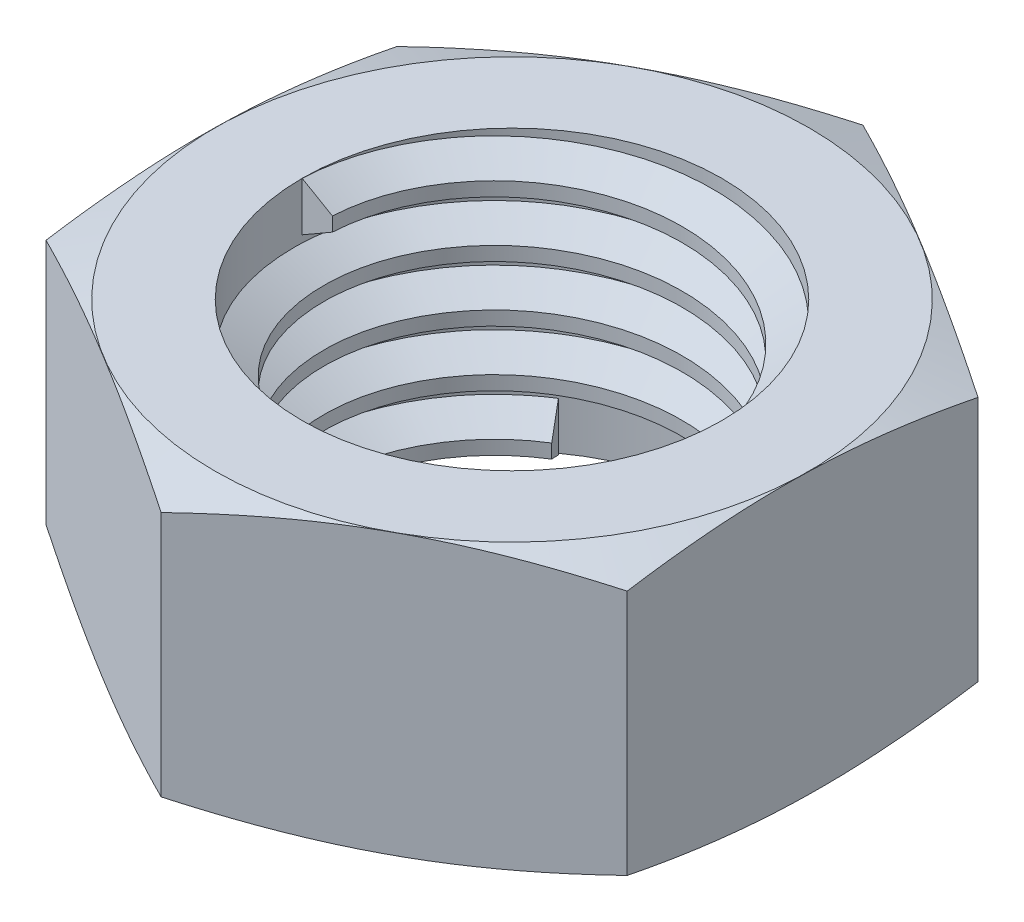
ISO-10303-21;
HEADER;
FILE_DESCRIPTION(('STEP AP214'),'2;1');
FILE_NAME('part.step','',(''),(''),'','','');
FILE_SCHEMA(('AUTOMOTIVE_DESIGN { 1 0 10303 214 1 1 1 1 }'));
ENDSEC;
DATA;
#1=APPLICATION_CONTEXT('core data for automotive mechanical design processes');
#2=APPLICATION_PROTOCOL_DEFINITION('international standard','automotive_design',2000,#1);
#3=PRODUCT_CONTEXT('',#1,'mechanical');
#4=PRODUCT('Part','Part','',(#3));
#5=PRODUCT_RELATED_PRODUCT_CATEGORY('part','',(#4));
#6=PRODUCT_DEFINITION_FORMATION('','',#4);
#7=PRODUCT_DEFINITION_CONTEXT('part definition',#1,'design');
#8=PRODUCT_DEFINITION('design','',#6,#7);
#9=PRODUCT_DEFINITION_SHAPE('','',#8);
#10=(LENGTH_UNIT() NAMED_UNIT(*) SI_UNIT(.MILLI.,.METRE.));
#11=(NAMED_UNIT(*) PLANE_ANGLE_UNIT() SI_UNIT($,.RADIAN.));
#12=(NAMED_UNIT(*) SI_UNIT($,.STERADIAN.) SOLID_ANGLE_UNIT());
#13=UNCERTAINTY_MEASURE_WITH_UNIT(LENGTH_MEASURE(1.E-05),#10,'distance_accuracy_value','');
#14=(GEOMETRIC_REPRESENTATION_CONTEXT(3) GLOBAL_UNCERTAINTY_ASSIGNED_CONTEXT((#13)) GLOBAL_UNIT_ASSIGNED_CONTEXT((#10,
#11,#12)) REPRESENTATION_CONTEXT('',''));
#15=CARTESIAN_POINT('',(0.,0.,0.));
#16=DIRECTION('',(0.,0.,1.));
#17=DIRECTION('',(1.,0.,0.));
#18=AXIS2_PLACEMENT_3D('',#15,#16,#17);
#19=CARTESIAN_POINT('',(0.,12.7,0.));
#20=DIRECTION('',(0.,1.,0.));
#21=DIRECTION('',(0.,0.,1.));
#22=AXIS2_PLACEMENT_3D('',#19,#20,#21);
#23=PLANE('',#22);
#24=CARTESIAN_POINT('',(0.,12.7,0.));
#25=DIRECTION('',(0.,1.,0.));
#26=DIRECTION('',(0.,0.,1.));
#27=AXIS2_PLACEMENT_3D('',#24,#25,#26);
#28=CIRCLE('',#27,9.525);
#29=CARTESIAN_POINT('',(-9.525,12.7,0.));
#30=VERTEX_POINT('',#29);
#31=EDGE_CURVE('E145',#30,#30,#28,.T.);
#32=ORIENTED_EDGE('',*,*,#31,.F.);
#33=EDGE_LOOP('',(#32));
#34=FACE_BOUND('',#33,.T.);
#35=CARTESIAN_POINT('',(0.,12.7,0.));
#36=DIRECTION('',(0.,-1.,0.));
#37=DIRECTION('',(0.,0.,-1.));
#38=AXIS2_PLACEMENT_3D('',#35,#36,#37);
#39=CIRCLE('',#38,13.4903591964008);
#40=CARTESIAN_POINT('',(0.,12.7,-13.4903591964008));
#41=VERTEX_POINT('',#40);
#42=EDGE_CURVE('E138',#41,#41,#39,.T.);
#43=ORIENTED_EDGE('',*,*,#42,.F.);
#44=EDGE_LOOP('',(#43));
#45=FACE_BOUND('',#44,.T.);
#46=ADVANCED_FACE('F36',(#34,#45),#23,.T.);
#47=CARTESIAN_POINT('',(0.,0.,0.));
#48=DIRECTION('',(0.,1.,0.));
#49=DIRECTION('',(0.,0.,1.));
#50=AXIS2_PLACEMENT_3D('',#47,#48,#49);
#51=PLANE('',#50);
#52=CARTESIAN_POINT('',(0.,0.,0.));
#53=DIRECTION('',(0.,1.,0.));
#54=DIRECTION('',(0.,0.,1.));
#55=AXIS2_PLACEMENT_3D('',#52,#53,#54);
#56=CIRCLE('',#55,9.525);
#57=CARTESIAN_POINT('',(-5.59865452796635,0.,-7.70588687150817));
#58=VERTEX_POINT('',#57);
#59=CARTESIAN_POINT('',(-6.72204774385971,0.,-6.74831083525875));
#60=VERTEX_POINT('',#59);
#61=EDGE_CURVE('E158',#58,#60,#56,.T.);
#62=ORIENTED_EDGE('',*,*,#61,.T.);
#63=EDGE_CURVE('E161',#60,#58,#56,.T.);
#64=ORIENTED_EDGE('',*,*,#63,.T.);
#65=EDGE_LOOP('',(#62,#64));
#66=FACE_BOUND('',#65,.T.);
#67=CARTESIAN_POINT('',(0.,0.,0.));
#68=DIRECTION('',(0.,-1.,0.));
#69=DIRECTION('',(0.,0.,-1.));
#70=AXIS2_PLACEMENT_3D('',#67,#68,#69);
#71=CIRCLE('',#70,13.4903591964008);
#72=CARTESIAN_POINT('',(0.,0.,-13.4903591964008));
#73=VERTEX_POINT('',#72);
#74=EDGE_CURVE('E448',#73,#73,#71,.T.);
#75=ORIENTED_EDGE('',*,*,#74,.T.);
#76=EDGE_LOOP('',(#75));
#77=FACE_BOUND('',#76,.T.);
#78=ADVANCED_FACE('F437',(#66,#77),#51,.F.);
#79=CARTESIAN_POINT('',(0.,12.7,0.));
#80=DIRECTION('',(0.,-1.,0.));
#81=DIRECTION('',(0.,0.,-1.));
#82=AXIS2_PLACEMENT_3D('',#79,#80,#81);
#83=CYLINDRICAL_SURFACE('',#82,9.525);
#84=CARTESIAN_POINT('',(-9.525,10.4775000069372,0.));
#85=CARTESIAN_POINT('',(-9.525,10.3505000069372,-3.09486010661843));
#86=CARTESIAN_POINT('',(-7.70588687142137,10.2235000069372,-5.59865452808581));
#87=CARTESIAN_POINT('',(-5.88677374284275,10.0965000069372,-8.10244894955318));
#88=CARTESIAN_POINT('',(-2.94338687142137,9.96950000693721,-9.05881331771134));
#89=CARTESIAN_POINT('',(0.,9.84250000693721,-10.0151776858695));
#90=CARTESIAN_POINT('',(2.94338687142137,9.71550000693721,-9.05881331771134));
#91=CARTESIAN_POINT('',(5.88677374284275,9.58850000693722,-8.10244894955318));
#92=CARTESIAN_POINT('',(7.70588687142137,9.46150000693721,-5.59865452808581));
#93=CARTESIAN_POINT('',(9.525,9.33450000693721,-3.09486010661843));
#94=CARTESIAN_POINT('',(9.525,9.20750000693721,0.));
#95=CARTESIAN_POINT('',(9.525,9.08050000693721,3.09486010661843));
#96=CARTESIAN_POINT('',(7.70588687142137,8.95350000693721,5.59865452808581));
#97=CARTESIAN_POINT('',(5.88677374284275,8.82650000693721,8.10244894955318));
#98=CARTESIAN_POINT('',(2.94338687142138,8.69950000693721,9.05881331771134));
#99=CARTESIAN_POINT('',(0.,8.57250000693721,10.0151776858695));
#100=CARTESIAN_POINT('',(-2.94338687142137,8.44550000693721,9.05881331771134));
#101=CARTESIAN_POINT('',(-5.88677374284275,8.31850000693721,8.10244894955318));
#102=CARTESIAN_POINT('',(-7.70588687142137,8.19150000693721,5.59865452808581));
#103=CARTESIAN_POINT('',(-9.525,8.06450000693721,3.09486010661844));
#104=CARTESIAN_POINT('',(-9.525,7.93750000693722,0.));
#105=CARTESIAN_POINT('',(-9.525,7.81050000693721,-3.09486010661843));
#106=CARTESIAN_POINT('',(-7.70588687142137,7.68350000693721,-5.59865452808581));
#107=CARTESIAN_POINT('',(-5.88677374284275,7.55650000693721,-8.10244894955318));
#108=CARTESIAN_POINT('',(-2.94338687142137,7.42950000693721,-9.05881331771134));
#109=CARTESIAN_POINT('',(0.,7.30250000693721,-10.0151776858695));
#110=CARTESIAN_POINT('',(2.94338687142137,7.17550000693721,-9.05881331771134));
#111=CARTESIAN_POINT('',(5.88677374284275,7.04850000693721,-8.10244894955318));
#112=CARTESIAN_POINT('',(7.70588687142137,6.92150000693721,-5.59865452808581));
#113=CARTESIAN_POINT('',(9.525,6.79450000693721,-3.09486010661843));
#114=CARTESIAN_POINT('',(9.525,6.66750000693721,0.));
#115=CARTESIAN_POINT('',(9.525,6.54050000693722,3.09486010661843));
#116=CARTESIAN_POINT('',(7.70588687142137,6.41350000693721,5.59865452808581));
#117=CARTESIAN_POINT('',(5.88677374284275,6.28650000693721,8.10244894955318));
#118=CARTESIAN_POINT('',(2.94338687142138,6.15950000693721,9.05881331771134));
#119=CARTESIAN_POINT('',(0.,6.03250000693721,10.0151776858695));
#120=CARTESIAN_POINT('',(-2.94338687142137,5.90550000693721,9.05881331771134));
#121=CARTESIAN_POINT('',(-5.88677374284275,5.77850000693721,8.10244894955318));
#122=CARTESIAN_POINT('',(-7.70588687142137,5.65150000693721,5.59865452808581));
#123=CARTESIAN_POINT('',(-9.525,5.52450000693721,3.09486010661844));
#124=CARTESIAN_POINT('',(-9.525,5.39750000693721,0.));
#125=CARTESIAN_POINT('',(-9.525,5.27050000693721,-3.09486010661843));
#126=CARTESIAN_POINT('',(-7.70588687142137,5.14350000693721,-5.59865452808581));
#127=CARTESIAN_POINT('',(-5.88677374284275,5.01650000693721,-8.10244894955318));
#128=CARTESIAN_POINT('',(-2.94338687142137,4.88950000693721,-9.05881331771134));
#129=CARTESIAN_POINT('',(0.,4.76250000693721,-10.0151776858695));
#130=CARTESIAN_POINT('',(2.94338687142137,4.63550000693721,-9.05881331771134));
#131=CARTESIAN_POINT('',(5.88677374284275,4.50850000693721,-8.10244894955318));
#132=CARTESIAN_POINT('',(7.70588687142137,4.38150000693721,-5.59865452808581));
#133=CARTESIAN_POINT('',(9.525,4.25450000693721,-3.09486010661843));
#134=CARTESIAN_POINT('',(9.525,4.12750000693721,0.));
#135=CARTESIAN_POINT('',(9.525,4.00050000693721,3.09486010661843));
#136=CARTESIAN_POINT('',(7.70588687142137,3.87350000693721,5.59865452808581));
#137=CARTESIAN_POINT('',(5.88677374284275,3.74650000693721,8.10244894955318));
#138=CARTESIAN_POINT('',(2.94338687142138,3.61950000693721,9.05881331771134));
#139=CARTESIAN_POINT('',(0.,3.49250000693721,10.0151776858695));
#140=CARTESIAN_POINT('',(-2.94338687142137,3.36550000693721,9.05881331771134));
#141=CARTESIAN_POINT('',(-5.88677374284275,3.23850000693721,8.10244894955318));
#142=CARTESIAN_POINT('',(-7.70588687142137,3.11150000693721,5.59865452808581));
#143=CARTESIAN_POINT('',(-9.525,2.98450000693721,3.09486010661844));
#144=CARTESIAN_POINT('',(-9.525,2.85750000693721,0.));
#145=CARTESIAN_POINT('',(-9.525,2.73050000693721,-3.09486010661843));
#146=CARTESIAN_POINT('',(-7.70588687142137,2.60350000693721,-5.59865452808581));
#147=CARTESIAN_POINT('',(-5.88677374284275,2.47650000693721,-8.10244894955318));
#148=CARTESIAN_POINT('',(-2.94338687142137,2.34950000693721,-9.05881331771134));
#149=CARTESIAN_POINT('',(0.,2.22250000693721,-10.0151776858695));
#150=CARTESIAN_POINT('',(2.94338687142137,2.09550000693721,-9.05881331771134));
#151=CARTESIAN_POINT('',(5.88677374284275,1.96850000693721,-8.10244894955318));
#152=CARTESIAN_POINT('',(7.70588687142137,1.84150000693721,-5.59865452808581));
#153=CARTESIAN_POINT('',(9.525,1.71450000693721,-3.09486010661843));
#154=CARTESIAN_POINT('',(9.525,1.58750000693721,0.));
#155=CARTESIAN_POINT('',(9.525,1.46050000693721,3.09486010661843));
#156=CARTESIAN_POINT('',(7.70588687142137,1.33350000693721,5.59865452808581));
#157=CARTESIAN_POINT('',(5.88677374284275,1.20650000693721,8.10244894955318));
#158=CARTESIAN_POINT('',(2.94338687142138,1.07950000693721,9.05881331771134));
#159=CARTESIAN_POINT('',(0.,0.952500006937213,10.0151776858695));
#160=CARTESIAN_POINT('',(-2.94338687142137,0.825500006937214,9.05881331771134));
#161=CARTESIAN_POINT('',(-5.88677374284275,0.698500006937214,8.10244894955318));
#162=CARTESIAN_POINT('',(-7.70588687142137,0.571500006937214,5.59865452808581));
#163=CARTESIAN_POINT('',(-9.525,0.444500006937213,3.09486010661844));
#164=CARTESIAN_POINT('',(-9.525,0.317500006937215,0.));
#165=CARTESIAN_POINT('',(-9.525,0.190500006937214,-3.09486010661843));
#166=CARTESIAN_POINT('',(-7.70588687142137,0.063500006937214,-5.59865452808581));
#167=CARTESIAN_POINT('',(-6.81914710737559,0.00159294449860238,-6.8191471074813));
#168=CARTESIAN_POINT('',(-5.59865452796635,-0.0634999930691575,-7.70588687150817));
#169=(BOUNDED_CURVE() B_SPLINE_CURVE(2,(#84,#85,#86,#87,#88,#89,#90,#91,#92,#93,#94,#95,#96,#97,
#98,#99,#100,#101,#102,#103,#104,#105,#106,#107,#108,#109,#110,#111,#112,#113,#114,#115,#116,
#117,#118,#119,#120,#121,#122,#123,#124,#125,#126,#127,#128,#129,#130,#131,#132,#133,#134,#135,
#136,#137,#138,#139,#140,#141,#142,#143,#144,#145,#146,#147,#148,#149,#150,#151,#152,#153,#154,
#155,#156,#157,#158,#159,#160,#161,#162,#163,#164,#165,#166,#167,#168),.UNSPECIFIED.,.F.,
.F.) B_SPLINE_CURVE_WITH_KNOTS((3,2,2,2,2,2,2,2,2,2,2,2,2,2,2,2,2,2,2,2,2,2,2,2,2,2,2,2,2,2,2,2,
2,2,2,2,2,2,2,2,2,2,3),(0.,0.02,0.04,0.06,0.08,0.1,0.12,0.14,0.16,0.18,0.2,0.22,0.24,0.26,0.28,
0.3,0.32,0.34,0.36,0.38,0.4,0.42,0.44,0.46,0.48,0.5,0.52,0.54,0.56,0.58,0.6,0.62,0.64,0.66,0.68,
0.7,0.72,0.74,0.76,0.78,0.8,0.82,0.830000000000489),
.UNSPECIFIED.) CURVE() GEOMETRIC_REPRESENTATION_ITEM() RATIONAL_B_SPLINE_CURVE((1.,
0.951056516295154,1.,0.951056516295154,1.,0.951056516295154,1.,0.951056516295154,1.,
0.951056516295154,1.,0.951056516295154,1.,0.951056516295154,1.,0.951056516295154,1.,
0.951056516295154,1.,0.951056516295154,1.,0.951056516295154,1.,0.951056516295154,1.,
0.951056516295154,1.,0.951056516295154,1.,0.951056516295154,1.,0.951056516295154,1.,
0.951056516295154,1.,0.951056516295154,1.,0.951056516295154,1.,0.951056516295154,1.,
0.951056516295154,1.,0.951056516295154,1.,0.951056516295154,1.,0.951056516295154,1.,
0.951056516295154,1.,0.951056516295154,1.,0.951056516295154,1.,0.951056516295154,1.,
0.951056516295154,1.,0.951056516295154,1.,0.951056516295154,1.,0.951056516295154,1.,
0.951056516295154,1.,0.951056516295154,1.,0.951056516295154,1.,0.951056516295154,1.,
0.951056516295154,1.,0.951056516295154,1.,0.951056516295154,1.,0.951056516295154,1.,
0.951056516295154,1.,0.975528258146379,0.975528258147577)) REPRESENTATION_ITEM(''));
#170=CARTESIAN_POINT('',(-9.525,10.4775000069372,0.));
#171=VERTEX_POINT('',#170);
#172=EDGE_CURVE('E129',#60,#171,#169,.F.);
#173=ORIENTED_EDGE('',*,*,#172,.T.);
#174=DIRECTION('',(0.,-1.,0.));
#175=VECTOR('',#174,1.);
#176=CARTESIAN_POINT('',(-9.525,11.5887500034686,0.));
#177=LINE('',#176,#175);
#178=EDGE_CURVE('E263',#30,#171,#177,.T.);
#179=ORIENTED_EDGE('',*,*,#178,.F.);
#180=ORIENTED_EDGE('',*,*,#31,.T.);
#181=CARTESIAN_POINT('',(-9.525,12.7,0.));
#182=CARTESIAN_POINT('',(-9.525,12.573,-3.09486010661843));
#183=CARTESIAN_POINT('',(-7.70588687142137,12.446,-5.59865452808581));
#184=CARTESIAN_POINT('',(-5.88677374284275,12.319,-8.10244894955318));
#185=CARTESIAN_POINT('',(-2.94338687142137,12.192,-9.05881331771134));
#186=CARTESIAN_POINT('',(0.,12.065,-10.0151776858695));
#187=CARTESIAN_POINT('',(2.94338687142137,11.938,-9.05881331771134));
#188=CARTESIAN_POINT('',(5.88677374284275,11.811,-8.10244894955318));
#189=CARTESIAN_POINT('',(7.70588687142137,11.684,-5.59865452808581));
#190=CARTESIAN_POINT('',(9.525,11.557,-3.09486010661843));
#191=CARTESIAN_POINT('',(9.525,11.43,0.));
#192=CARTESIAN_POINT('',(9.525,11.303,3.09486010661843));
#193=CARTESIAN_POINT('',(7.70588687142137,11.176,5.59865452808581));
#194=CARTESIAN_POINT('',(5.88677374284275,11.049,8.10244894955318));
#195=CARTESIAN_POINT('',(2.94338687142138,10.922,9.05881331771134));
#196=CARTESIAN_POINT('',(0.,10.795,10.0151776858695));
#197=CARTESIAN_POINT('',(-2.94338687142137,10.668,9.05881331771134));
#198=CARTESIAN_POINT('',(-5.88677374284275,10.541,8.10244894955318));
#199=CARTESIAN_POINT('',(-7.70588687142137,10.414,5.59865452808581));
#200=CARTESIAN_POINT('',(-9.525,10.287,3.09486010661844));
#201=CARTESIAN_POINT('',(-9.525,10.16,0.));
#202=CARTESIAN_POINT('',(-9.525,10.033,-3.09486010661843));
#203=CARTESIAN_POINT('',(-7.70588687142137,9.906,-5.59865452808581));
#204=CARTESIAN_POINT('',(-5.88677374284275,9.779,-8.10244894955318));
#205=CARTESIAN_POINT('',(-2.94338687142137,9.652,-9.05881331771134));
#206=CARTESIAN_POINT('',(0.,9.525,-10.0151776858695));
#207=CARTESIAN_POINT('',(2.94338687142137,9.398,-9.05881331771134));
#208=CARTESIAN_POINT('',(5.88677374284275,9.271,-8.10244894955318));
#209=CARTESIAN_POINT('',(7.70588687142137,9.144,-5.59865452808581));
#210=CARTESIAN_POINT('',(9.525,9.017,-3.09486010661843));
#211=CARTESIAN_POINT('',(9.525,8.89,0.));
#212=CARTESIAN_POINT('',(9.525,8.763,3.09486010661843));
#213=CARTESIAN_POINT('',(7.70588687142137,8.636,5.59865452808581));
#214=CARTESIAN_POINT('',(5.88677374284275,8.509,8.10244894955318));
#215=CARTESIAN_POINT('',(2.94338687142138,8.382,9.05881331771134));
#216=CARTESIAN_POINT('',(0.,8.255,10.0151776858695));
#217=CARTESIAN_POINT('',(-2.94338687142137,8.128,9.05881331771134));
#218=CARTESIAN_POINT('',(-5.88677374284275,8.001,8.10244894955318));
#219=CARTESIAN_POINT('',(-7.70588687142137,7.874,5.59865452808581));
#220=CARTESIAN_POINT('',(-9.525,7.747,3.09486010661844));
#221=CARTESIAN_POINT('',(-9.525,7.62,0.));
#222=CARTESIAN_POINT('',(-9.525,7.493,-3.09486010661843));
#223=CARTESIAN_POINT('',(-7.70588687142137,7.366,-5.59865452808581));
#224=CARTESIAN_POINT('',(-5.88677374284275,7.239,-8.10244894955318));
#225=CARTESIAN_POINT('',(-2.94338687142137,7.112,-9.05881331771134));
#226=CARTESIAN_POINT('',(0.,6.985,-10.0151776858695));
#227=CARTESIAN_POINT('',(2.94338687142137,6.858,-9.05881331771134));
#228=CARTESIAN_POINT('',(5.88677374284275,6.731,-8.10244894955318));
#229=CARTESIAN_POINT('',(7.70588687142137,6.604,-5.59865452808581));
#230=CARTESIAN_POINT('',(9.525,6.477,-3.09486010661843));
#231=CARTESIAN_POINT('',(9.525,6.35,0.));
#232=CARTESIAN_POINT('',(9.525,6.223,3.09486010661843));
#233=CARTESIAN_POINT('',(7.70588687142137,6.096,5.59865452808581));
#234=CARTESIAN_POINT('',(5.88677374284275,5.969,8.10244894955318));
#235=CARTESIAN_POINT('',(2.94338687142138,5.842,9.05881331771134));
#236=CARTESIAN_POINT('',(0.,5.715,10.0151776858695));
#237=CARTESIAN_POINT('',(-2.94338687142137,5.588,9.05881331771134));
#238=CARTESIAN_POINT('',(-5.88677374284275,5.461,8.10244894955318));
#239=CARTESIAN_POINT('',(-7.70588687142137,5.334,5.59865452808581));
#240=CARTESIAN_POINT('',(-9.525,5.207,3.09486010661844));
#241=CARTESIAN_POINT('',(-9.525,5.08,0.));
#242=CARTESIAN_POINT('',(-9.525,4.953,-3.09486010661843));
#243=CARTESIAN_POINT('',(-7.70588687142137,4.826,-5.59865452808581));
#244=CARTESIAN_POINT('',(-5.88677374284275,4.699,-8.10244894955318));
#245=CARTESIAN_POINT('',(-2.94338687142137,4.572,-9.05881331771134));
#246=CARTESIAN_POINT('',(0.,4.445,-10.0151776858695));
#247=CARTESIAN_POINT('',(2.94338687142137,4.318,-9.05881331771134));
#248=CARTESIAN_POINT('',(5.88677374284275,4.191,-8.10244894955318));
#249=CARTESIAN_POINT('',(7.70588687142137,4.064,-5.59865452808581));
#250=CARTESIAN_POINT('',(9.525,3.937,-3.09486010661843));
#251=CARTESIAN_POINT('',(9.525,3.81,0.));
#252=CARTESIAN_POINT('',(9.525,3.683,3.09486010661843));
#253=CARTESIAN_POINT('',(7.70588687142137,3.556,5.59865452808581));
#254=CARTESIAN_POINT('',(5.88677374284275,3.429,8.10244894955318));
#255=CARTESIAN_POINT('',(2.94338687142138,3.302,9.05881331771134));
#256=CARTESIAN_POINT('',(0.,3.175,10.0151776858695));
#257=CARTESIAN_POINT('',(-2.94338687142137,3.048,9.05881331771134));
#258=CARTESIAN_POINT('',(-5.88677374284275,2.921,8.10244894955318));
#259=CARTESIAN_POINT('',(-7.70588687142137,2.794,5.59865452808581));
#260=CARTESIAN_POINT('',(-9.525,2.667,3.09486010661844));
#261=CARTESIAN_POINT('',(-9.525,2.54,0.));
#262=CARTESIAN_POINT('',(-9.525,2.413,-3.09486010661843));
#263=CARTESIAN_POINT('',(-7.70588687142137,2.286,-5.59865452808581));
#264=CARTESIAN_POINT('',(-6.81914710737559,2.22409293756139,-6.8191471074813));
#265=CARTESIAN_POINT('',(-5.59865452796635,2.15899999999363,-7.70588687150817));
#266=(BOUNDED_CURVE() B_SPLINE_CURVE(2,(#181,#182,#183,#184,#185,#186,#187,#188,#189,#190,#191,
#192,#193,#194,#195,#196,#197,#198,#199,#200,#201,#202,#203,#204,#205,#206,#207,#208,#209,#210,
#211,#212,#213,#214,#215,#216,#217,#218,#219,#220,#221,#222,#223,#224,#225,#226,#227,#228,#229,
#230,#231,#232,#233,#234,#235,#236,#237,#238,#239,#240,#241,#242,#243,#244,#245,#246,#247,#248,
#249,#250,#251,#252,#253,#254,#255,#256,#257,#258,#259,#260,#261,#262,#263,#264,#265),
.UNSPECIFIED.,.F.,.F.) B_SPLINE_CURVE_WITH_KNOTS((3,2,2,2,2,2,2,2,2,2,2,2,2,2,2,2,2,2,2,2,2,2,2,
2,2,2,2,2,2,2,2,2,2,2,2,2,2,2,2,2,2,2,3),(0.,0.02,0.04,0.06,0.08,0.1,0.12,0.14,0.16,0.18,0.2,
0.22,0.24,0.26,0.28,0.3,0.32,0.34,0.36,0.38,0.4,0.42,0.44,0.46,0.48,0.5,0.52,0.54,0.56,0.58,0.6,
0.62,0.64,0.66,0.68,0.7,0.72,0.74,0.76,0.78,0.8,0.82,0.830000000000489),
.UNSPECIFIED.) CURVE() GEOMETRIC_REPRESENTATION_ITEM() RATIONAL_B_SPLINE_CURVE((1.,
0.951056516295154,1.,0.951056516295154,1.,0.951056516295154,1.,0.951056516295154,1.,
0.951056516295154,1.,0.951056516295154,1.,0.951056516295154,1.,0.951056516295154,1.,
0.951056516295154,1.,0.951056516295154,1.,0.951056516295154,1.,0.951056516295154,1.,
0.951056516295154,1.,0.951056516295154,1.,0.951056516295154,1.,0.951056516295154,1.,
0.951056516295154,1.,0.951056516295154,1.,0.951056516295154,1.,0.951056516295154,1.,
0.951056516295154,1.,0.951056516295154,1.,0.951056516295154,1.,0.951056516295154,1.,
0.951056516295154,1.,0.951056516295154,1.,0.951056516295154,1.,0.951056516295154,1.,
0.951056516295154,1.,0.951056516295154,1.,0.951056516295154,1.,0.951056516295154,1.,
0.951056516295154,1.,0.951056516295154,1.,0.951056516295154,1.,0.951056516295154,1.,
0.951056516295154,1.,0.951056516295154,1.,0.951056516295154,1.,0.951056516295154,1.,
0.951056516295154,1.,0.975528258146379,0.975528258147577)) REPRESENTATION_ITEM(''));
#267=CARTESIAN_POINT('',(-5.59865452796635,2.15899999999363,-7.70588687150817));
#268=VERTEX_POINT('',#267);
#269=EDGE_CURVE('E157',#268,#30,#266,.F.);
#270=ORIENTED_EDGE('',*,*,#269,.F.);
#271=DIRECTION('',(-1.30338438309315E-13,1.,0.));
#272=VECTOR('',#271,1.);
#273=CARTESIAN_POINT('',(-5.59865452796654,1.96056250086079,-7.70588687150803));
#274=LINE('',#273,#272);
#275=EDGE_CURVE('E169',#58,#268,#274,.T.);
#276=ORIENTED_EDGE('',*,*,#275,.F.);
#277=ORIENTED_EDGE('',*,*,#63,.F.);
#278=EDGE_LOOP('',(#173,#179,#180,#270,#276,#277));
#279=FACE_BOUND('',#278,.T.);
#280=ADVANCED_FACE('F364',(#279),#83,.F.);
#281=CARTESIAN_POINT('',(-9.525,12.7,0.));
#282=CARTESIAN_POINT('',(-9.525,12.573,-3.09486010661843));
#283=CARTESIAN_POINT('',(-7.70588687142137,12.446,-5.59865452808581));
#284=CARTESIAN_POINT('',(-5.88677374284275,12.319,-8.10244894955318));
#285=CARTESIAN_POINT('',(-2.94338687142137,12.192,-9.05881331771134));
#286=CARTESIAN_POINT('',(0.,12.065,-10.0151776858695));
#287=CARTESIAN_POINT('',(2.94338687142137,11.938,-9.05881331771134));
#288=CARTESIAN_POINT('',(5.88677374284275,11.811,-8.10244894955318));
#289=CARTESIAN_POINT('',(7.70588687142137,11.684,-5.59865452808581));
#290=CARTESIAN_POINT('',(9.525,11.557,-3.09486010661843));
#291=CARTESIAN_POINT('',(9.525,11.43,0.));
#292=CARTESIAN_POINT('',(9.525,11.303,3.09486010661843));
#293=CARTESIAN_POINT('',(7.70588687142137,11.176,5.59865452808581));
#294=CARTESIAN_POINT('',(5.88677374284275,11.049,8.10244894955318));
#295=CARTESIAN_POINT('',(2.94338687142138,10.922,9.05881331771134));
#296=CARTESIAN_POINT('',(0.,10.795,10.0151776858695));
#297=CARTESIAN_POINT('',(-2.94338687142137,10.668,9.05881331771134));
#298=CARTESIAN_POINT('',(-5.88677374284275,10.541,8.10244894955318));
#299=CARTESIAN_POINT('',(-7.70588687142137,10.414,5.59865452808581));
#300=CARTESIAN_POINT('',(-9.525,10.287,3.09486010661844));
#301=CARTESIAN_POINT('',(-9.525,10.16,0.));
#302=CARTESIAN_POINT('',(-9.525,10.033,-3.09486010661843));
#303=CARTESIAN_POINT('',(-7.70588687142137,9.906,-5.59865452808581));
#304=CARTESIAN_POINT('',(-5.88677374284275,9.779,-8.10244894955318));
#305=CARTESIAN_POINT('',(-2.94338687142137,9.652,-9.05881331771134));
#306=CARTESIAN_POINT('',(0.,9.525,-10.0151776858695));
#307=CARTESIAN_POINT('',(2.94338687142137,9.398,-9.05881331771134));
#308=CARTESIAN_POINT('',(5.88677374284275,9.271,-8.10244894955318));
#309=CARTESIAN_POINT('',(7.70588687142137,9.144,-5.59865452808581));
#310=CARTESIAN_POINT('',(9.525,9.017,-3.09486010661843));
#311=CARTESIAN_POINT('',(9.525,8.89,0.));
#312=CARTESIAN_POINT('',(9.525,8.763,3.09486010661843));
#313=CARTESIAN_POINT('',(7.70588687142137,8.636,5.59865452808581));
#314=CARTESIAN_POINT('',(5.88677374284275,8.509,8.10244894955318));
#315=CARTESIAN_POINT('',(2.94338687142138,8.382,9.05881331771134));
#316=CARTESIAN_POINT('',(0.,8.255,10.0151776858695));
#317=CARTESIAN_POINT('',(-2.94338687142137,8.128,9.05881331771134));
#318=CARTESIAN_POINT('',(-5.88677374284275,8.001,8.10244894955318));
#319=CARTESIAN_POINT('',(-7.70588687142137,7.874,5.59865452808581));
#320=CARTESIAN_POINT('',(-9.525,7.747,3.09486010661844));
#321=CARTESIAN_POINT('',(-9.525,7.62,0.));
#322=CARTESIAN_POINT('',(-9.525,7.493,-3.09486010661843));
#323=CARTESIAN_POINT('',(-7.70588687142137,7.366,-5.59865452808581));
#324=CARTESIAN_POINT('',(-5.88677374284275,7.239,-8.10244894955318));
#325=CARTESIAN_POINT('',(-2.94338687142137,7.112,-9.05881331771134));
#326=CARTESIAN_POINT('',(0.,6.985,-10.0151776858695));
#327=CARTESIAN_POINT('',(2.94338687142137,6.858,-9.05881331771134));
#328=CARTESIAN_POINT('',(5.88677374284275,6.731,-8.10244894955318));
#329=CARTESIAN_POINT('',(7.70588687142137,6.604,-5.59865452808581));
#330=CARTESIAN_POINT('',(9.525,6.477,-3.09486010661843));
#331=CARTESIAN_POINT('',(9.525,6.35,0.));
#332=CARTESIAN_POINT('',(9.525,6.223,3.09486010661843));
#333=CARTESIAN_POINT('',(7.70588687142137,6.096,5.59865452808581));
#334=CARTESIAN_POINT('',(5.88677374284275,5.969,8.10244894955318));
#335=CARTESIAN_POINT('',(2.94338687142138,5.842,9.05881331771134));
#336=CARTESIAN_POINT('',(0.,5.715,10.0151776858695));
#337=CARTESIAN_POINT('',(-2.94338687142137,5.588,9.05881331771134));
#338=CARTESIAN_POINT('',(-5.88677374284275,5.461,8.10244894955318));
#339=CARTESIAN_POINT('',(-7.70588687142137,5.334,5.59865452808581));
#340=CARTESIAN_POINT('',(-9.525,5.207,3.09486010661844));
#341=CARTESIAN_POINT('',(-9.525,5.08,0.));
#342=CARTESIAN_POINT('',(-9.525,4.953,-3.09486010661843));
#343=CARTESIAN_POINT('',(-7.70588687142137,4.826,-5.59865452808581));
#344=CARTESIAN_POINT('',(-5.88677374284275,4.699,-8.10244894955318));
#345=CARTESIAN_POINT('',(-2.94338687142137,4.572,-9.05881331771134));
#346=CARTESIAN_POINT('',(0.,4.445,-10.0151776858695));
#347=CARTESIAN_POINT('',(2.94338687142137,4.318,-9.05881331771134));
#348=CARTESIAN_POINT('',(5.88677374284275,4.191,-8.10244894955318));
#349=CARTESIAN_POINT('',(7.70588687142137,4.064,-5.59865452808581));
#350=CARTESIAN_POINT('',(9.525,3.937,-3.09486010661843));
#351=CARTESIAN_POINT('',(9.525,3.81,0.));
#352=CARTESIAN_POINT('',(9.525,3.683,3.09486010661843));
#353=CARTESIAN_POINT('',(7.70588687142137,3.556,5.59865452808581));
#354=CARTESIAN_POINT('',(5.88677374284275,3.429,8.10244894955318));
#355=CARTESIAN_POINT('',(2.94338687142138,3.302,9.05881331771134));
#356=CARTESIAN_POINT('',(0.,3.175,10.0151776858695));
#357=CARTESIAN_POINT('',(-2.94338687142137,3.048,9.05881331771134));
#358=CARTESIAN_POINT('',(-5.88677374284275,2.921,8.10244894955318));
#359=CARTESIAN_POINT('',(-7.70588687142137,2.794,5.59865452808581));
#360=CARTESIAN_POINT('',(-9.525,2.667,3.09486010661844));
#361=CARTESIAN_POINT('',(-9.525,2.54,0.));
#362=CARTESIAN_POINT('',(-9.525,2.413,-3.09486010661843));
#363=CARTESIAN_POINT('',(-7.70588687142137,2.286,-5.59865452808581));
#364=CARTESIAN_POINT('',(-6.81914710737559,2.22409293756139,-6.8191471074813));
#365=CARTESIAN_POINT('',(-5.59865452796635,2.15899999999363,-7.70588687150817));
#366=CARTESIAN_POINT('',(-9.525,10.4775000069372,0.));
#367=CARTESIAN_POINT('',(-9.525,10.3505000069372,-3.09486010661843));
#368=CARTESIAN_POINT('',(-7.70588687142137,10.2235000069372,-5.59865452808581));
#369=CARTESIAN_POINT('',(-5.88677374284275,10.0965000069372,-8.10244894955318));
#370=CARTESIAN_POINT('',(-2.94338687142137,9.96950000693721,-9.05881331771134));
#371=CARTESIAN_POINT('',(0.,9.84250000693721,-10.0151776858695));
#372=CARTESIAN_POINT('',(2.94338687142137,9.71550000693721,-9.05881331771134));
#373=CARTESIAN_POINT('',(5.88677374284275,9.58850000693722,-8.10244894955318));
#374=CARTESIAN_POINT('',(7.70588687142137,9.46150000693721,-5.59865452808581));
#375=CARTESIAN_POINT('',(9.525,9.33450000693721,-3.09486010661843));
#376=CARTESIAN_POINT('',(9.525,9.20750000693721,0.));
#377=CARTESIAN_POINT('',(9.525,9.08050000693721,3.09486010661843));
#378=CARTESIAN_POINT('',(7.70588687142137,8.95350000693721,5.59865452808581));
#379=CARTESIAN_POINT('',(5.88677374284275,8.82650000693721,8.10244894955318));
#380=CARTESIAN_POINT('',(2.94338687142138,8.69950000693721,9.05881331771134));
#381=CARTESIAN_POINT('',(0.,8.57250000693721,10.0151776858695));
#382=CARTESIAN_POINT('',(-2.94338687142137,8.44550000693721,9.05881331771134));
#383=CARTESIAN_POINT('',(-5.88677374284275,8.31850000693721,8.10244894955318));
#384=CARTESIAN_POINT('',(-7.70588687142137,8.19150000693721,5.59865452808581));
#385=CARTESIAN_POINT('',(-9.525,8.06450000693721,3.09486010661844));
#386=CARTESIAN_POINT('',(-9.525,7.93750000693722,0.));
#387=CARTESIAN_POINT('',(-9.525,7.81050000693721,-3.09486010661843));
#388=CARTESIAN_POINT('',(-7.70588687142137,7.68350000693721,-5.59865452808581));
#389=CARTESIAN_POINT('',(-5.88677374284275,7.55650000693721,-8.10244894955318));
#390=CARTESIAN_POINT('',(-2.94338687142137,7.42950000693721,-9.05881331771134));
#391=CARTESIAN_POINT('',(0.,7.30250000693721,-10.0151776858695));
#392=CARTESIAN_POINT('',(2.94338687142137,7.17550000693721,-9.05881331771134));
#393=CARTESIAN_POINT('',(5.88677374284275,7.04850000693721,-8.10244894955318));
#394=CARTESIAN_POINT('',(7.70588687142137,6.92150000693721,-5.59865452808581));
#395=CARTESIAN_POINT('',(9.525,6.79450000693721,-3.09486010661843));
#396=CARTESIAN_POINT('',(9.525,6.66750000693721,0.));
#397=CARTESIAN_POINT('',(9.525,6.54050000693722,3.09486010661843));
#398=CARTESIAN_POINT('',(7.70588687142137,6.41350000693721,5.59865452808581));
#399=CARTESIAN_POINT('',(5.88677374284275,6.28650000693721,8.10244894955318));
#400=CARTESIAN_POINT('',(2.94338687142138,6.15950000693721,9.05881331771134));
#401=CARTESIAN_POINT('',(0.,6.03250000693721,10.0151776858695));
#402=CARTESIAN_POINT('',(-2.94338687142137,5.90550000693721,9.05881331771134));
#403=CARTESIAN_POINT('',(-5.88677374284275,5.77850000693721,8.10244894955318));
#404=CARTESIAN_POINT('',(-7.70588687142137,5.65150000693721,5.59865452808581));
#405=CARTESIAN_POINT('',(-9.525,5.52450000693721,3.09486010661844));
#406=CARTESIAN_POINT('',(-9.525,5.39750000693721,0.));
#407=CARTESIAN_POINT('',(-9.525,5.27050000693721,-3.09486010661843));
#408=CARTESIAN_POINT('',(-7.70588687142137,5.14350000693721,-5.59865452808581));
#409=CARTESIAN_POINT('',(-5.88677374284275,5.01650000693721,-8.10244894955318));
#410=CARTESIAN_POINT('',(-2.94338687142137,4.88950000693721,-9.05881331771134));
#411=CARTESIAN_POINT('',(0.,4.76250000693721,-10.0151776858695));
#412=CARTESIAN_POINT('',(2.94338687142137,4.63550000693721,-9.05881331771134));
#413=CARTESIAN_POINT('',(5.88677374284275,4.50850000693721,-8.10244894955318));
#414=CARTESIAN_POINT('',(7.70588687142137,4.38150000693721,-5.59865452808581));
#415=CARTESIAN_POINT('',(9.525,4.25450000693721,-3.09486010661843));
#416=CARTESIAN_POINT('',(9.525,4.12750000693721,0.));
#417=CARTESIAN_POINT('',(9.525,4.00050000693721,3.09486010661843));
#418=CARTESIAN_POINT('',(7.70588687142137,3.87350000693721,5.59865452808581));
#419=CARTESIAN_POINT('',(5.88677374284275,3.74650000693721,8.10244894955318));
#420=CARTESIAN_POINT('',(2.94338687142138,3.61950000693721,9.05881331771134));
#421=CARTESIAN_POINT('',(0.,3.49250000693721,10.0151776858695));
#422=CARTESIAN_POINT('',(-2.94338687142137,3.36550000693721,9.05881331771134));
#423=CARTESIAN_POINT('',(-5.88677374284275,3.23850000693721,8.10244894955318));
#424=CARTESIAN_POINT('',(-7.70588687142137,3.11150000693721,5.59865452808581));
#425=CARTESIAN_POINT('',(-9.525,2.98450000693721,3.09486010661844));
#426=CARTESIAN_POINT('',(-9.525,2.85750000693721,0.));
#427=CARTESIAN_POINT('',(-9.525,2.73050000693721,-3.09486010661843));
#428=CARTESIAN_POINT('',(-7.70588687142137,2.60350000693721,-5.59865452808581));
#429=CARTESIAN_POINT('',(-5.88677374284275,2.47650000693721,-8.10244894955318));
#430=CARTESIAN_POINT('',(-2.94338687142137,2.34950000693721,-9.05881331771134));
#431=CARTESIAN_POINT('',(0.,2.22250000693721,-10.0151776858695));
#432=CARTESIAN_POINT('',(2.94338687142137,2.09550000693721,-9.05881331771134));
#433=CARTESIAN_POINT('',(5.88677374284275,1.96850000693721,-8.10244894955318));
#434=CARTESIAN_POINT('',(7.70588687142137,1.84150000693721,-5.59865452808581));
#435=CARTESIAN_POINT('',(9.525,1.71450000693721,-3.09486010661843));
#436=CARTESIAN_POINT('',(9.525,1.58750000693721,0.));
#437=CARTESIAN_POINT('',(9.525,1.46050000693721,3.09486010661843));
#438=CARTESIAN_POINT('',(7.70588687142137,1.33350000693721,5.59865452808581));
#439=CARTESIAN_POINT('',(5.88677374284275,1.20650000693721,8.10244894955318));
#440=CARTESIAN_POINT('',(2.94338687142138,1.07950000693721,9.05881331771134));
#441=CARTESIAN_POINT('',(0.,0.952500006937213,10.0151776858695));
#442=CARTESIAN_POINT('',(-2.94338687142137,0.825500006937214,9.05881331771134));
#443=CARTESIAN_POINT('',(-5.88677374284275,0.698500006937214,8.10244894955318));
#444=CARTESIAN_POINT('',(-7.70588687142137,0.571500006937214,5.59865452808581));
#445=CARTESIAN_POINT('',(-9.525,0.444500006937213,3.09486010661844));
#446=CARTESIAN_POINT('',(-9.525,0.317500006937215,0.));
#447=CARTESIAN_POINT('',(-9.525,0.190500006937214,-3.09486010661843));
#448=CARTESIAN_POINT('',(-7.70588687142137,0.063500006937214,-5.59865452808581));
#449=CARTESIAN_POINT('',(-6.81914710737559,0.00159294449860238,-6.8191471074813));
#450=CARTESIAN_POINT('',(-5.59865452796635,-0.0634999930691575,-7.70588687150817));
#451=(BOUNDED_SURFACE() B_SPLINE_SURFACE(1,2,((#281,#282,#283,#284,#285,#286,#287,#288,#289,
#290,#291,#292,#293,#294,#295,#296,#297,#298,#299,#300,#301,#302,#303,#304,#305,#306,#307,#308,
#309,#310,#311,#312,#313,#314,#315,#316,#317,#318,#319,#320,#321,#322,#323,#324,#325,#326,#327,
#328,#329,#330,#331,#332,#333,#334,#335,#336,#337,#338,#339,#340,#341,#342,#343,#344,#345,#346,
#347,#348,#349,#350,#351,#352,#353,#354,#355,#356,#357,#358,#359,#360,#361,#362,#363,#364,#365),
(#366,#367,#368,#369,#370,#371,#372,#373,#374,#375,#376,#377,#378,#379,#380,#381,#382,#383,#384,
#385,#386,#387,#388,#389,#390,#391,#392,#393,#394,#395,#396,#397,#398,#399,#400,#401,#402,#403,
#404,#405,#406,#407,#408,#409,#410,#411,#412,#413,#414,#415,#416,#417,#418,#419,#420,#421,#422,
#423,#424,#425,#426,#427,#428,#429,#430,#431,#432,#433,#434,#435,#436,#437,#438,#439,#440,#441,
#442,#443,#444,#445,#446,#447,#448,#449,#450)),.UNSPECIFIED.,.F.,.F.,
.F.) B_SPLINE_SURFACE_WITH_KNOTS((2,2),(3,2,2,2,2,2,2,2,2,2,2,2,2,2,2,2,2,2,2,2,2,2,2,2,2,2,2,2,
2,2,2,2,2,2,2,2,2,2,2,2,2,2,3),(0.,1.),(0.,0.02,0.04,0.06,0.08,0.1,0.12,0.14,0.16,0.18,0.2,0.22,
0.24,0.26,0.28,0.3,0.32,0.34,0.36,0.38,0.4,0.42,0.44,0.46,0.48,0.5,0.52,0.54,0.56,0.58,0.6,0.62,
0.64,0.66,0.68,0.7,0.72,0.74,0.76,0.78,0.8,0.82,0.830000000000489),
.UNSPECIFIED.) GEOMETRIC_REPRESENTATION_ITEM() RATIONAL_B_SPLINE_SURFACE(((1.,0.951056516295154,
1.,0.951056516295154,1.,0.951056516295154,1.,0.951056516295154,1.,0.951056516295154,1.,
0.951056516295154,1.,0.951056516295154,1.,0.951056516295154,1.,0.951056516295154,1.,
0.951056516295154,1.,0.951056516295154,1.,0.951056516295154,1.,0.951056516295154,1.,
0.951056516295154,1.,0.951056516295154,1.,0.951056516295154,1.,0.951056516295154,1.,
0.951056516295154,1.,0.951056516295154,1.,0.951056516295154,1.,0.951056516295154,1.,
0.951056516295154,1.,0.951056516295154,1.,0.951056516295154,1.,0.951056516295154,1.,
0.951056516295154,1.,0.951056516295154,1.,0.951056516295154,1.,0.951056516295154,1.,
0.951056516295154,1.,0.951056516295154,1.,0.951056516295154,1.,0.951056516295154,1.,
0.951056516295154,1.,0.951056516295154,1.,0.951056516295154,1.,0.951056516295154,1.,
0.951056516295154,1.,0.951056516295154,1.,0.951056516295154,1.,0.951056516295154,1.,
0.975528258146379,0.975528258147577),(1.,0.951056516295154,1.,0.951056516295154,1.,
0.951056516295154,1.,0.951056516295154,1.,0.951056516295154,1.,0.951056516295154,1.,
0.951056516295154,1.,0.951056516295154,1.,0.951056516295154,1.,0.951056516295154,1.,
0.951056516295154,1.,0.951056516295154,1.,0.951056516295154,1.,0.951056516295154,1.,
0.951056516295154,1.,0.951056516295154,1.,0.951056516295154,1.,0.951056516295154,1.,
0.951056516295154,1.,0.951056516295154,1.,0.951056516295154,1.,0.951056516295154,1.,
0.951056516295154,1.,0.951056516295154,1.,0.951056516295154,1.,0.951056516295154,1.,
0.951056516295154,1.,0.951056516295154,1.,0.951056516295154,1.,0.951056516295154,1.,
0.951056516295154,1.,0.951056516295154,1.,0.951056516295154,1.,0.951056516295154,1.,
0.951056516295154,1.,0.951056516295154,1.,0.951056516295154,1.,0.951056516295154,1.,
0.951056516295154,1.,0.951056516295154,1.,0.951056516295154,1.,0.975528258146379,0.975528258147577))) REPRESENTATION_ITEM('') SURFACE());
#452=CARTESIAN_POINT('',(-9.525,10.4775000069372,0.));
#453=CARTESIAN_POINT('',(-9.525,10.3505000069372,-3.09486010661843));
#454=CARTESIAN_POINT('',(-7.70588687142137,10.2235000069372,-5.59865452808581));
#455=CARTESIAN_POINT('',(-5.88677374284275,10.0965000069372,-8.10244894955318));
#456=CARTESIAN_POINT('',(-2.94338687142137,9.96950000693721,-9.05881331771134));
#457=CARTESIAN_POINT('',(0.,9.84250000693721,-10.0151776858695));
#458=CARTESIAN_POINT('',(2.94338687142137,9.71550000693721,-9.05881331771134));
#459=CARTESIAN_POINT('',(5.88677374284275,9.58850000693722,-8.10244894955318));
#460=CARTESIAN_POINT('',(7.70588687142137,9.46150000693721,-5.59865452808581));
#461=CARTESIAN_POINT('',(9.525,9.33450000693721,-3.09486010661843));
#462=CARTESIAN_POINT('',(9.525,9.20750000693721,0.));
#463=CARTESIAN_POINT('',(9.525,9.08050000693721,3.09486010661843));
#464=CARTESIAN_POINT('',(7.70588687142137,8.95350000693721,5.59865452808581));
#465=CARTESIAN_POINT('',(5.88677374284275,8.82650000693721,8.10244894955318));
#466=CARTESIAN_POINT('',(2.94338687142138,8.69950000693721,9.05881331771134));
#467=CARTESIAN_POINT('',(0.,8.57250000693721,10.0151776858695));
#468=CARTESIAN_POINT('',(-2.94338687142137,8.44550000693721,9.05881331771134));
#469=CARTESIAN_POINT('',(-5.88677374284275,8.31850000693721,8.10244894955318));
#470=CARTESIAN_POINT('',(-7.70588687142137,8.19150000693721,5.59865452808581));
#471=CARTESIAN_POINT('',(-9.525,8.06450000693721,3.09486010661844));
#472=CARTESIAN_POINT('',(-9.525,7.93750000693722,0.));
#473=CARTESIAN_POINT('',(-9.525,7.81050000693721,-3.09486010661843));
#474=CARTESIAN_POINT('',(-7.70588687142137,7.68350000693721,-5.59865452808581));
#475=CARTESIAN_POINT('',(-5.88677374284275,7.55650000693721,-8.10244894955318));
#476=CARTESIAN_POINT('',(-2.94338687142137,7.42950000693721,-9.05881331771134));
#477=CARTESIAN_POINT('',(0.,7.30250000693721,-10.0151776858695));
#478=CARTESIAN_POINT('',(2.94338687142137,7.17550000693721,-9.05881331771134));
#479=CARTESIAN_POINT('',(5.88677374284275,7.04850000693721,-8.10244894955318));
#480=CARTESIAN_POINT('',(7.70588687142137,6.92150000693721,-5.59865452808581));
#481=CARTESIAN_POINT('',(9.525,6.79450000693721,-3.09486010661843));
#482=CARTESIAN_POINT('',(9.525,6.66750000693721,0.));
#483=CARTESIAN_POINT('',(9.525,6.54050000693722,3.09486010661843));
#484=CARTESIAN_POINT('',(7.70588687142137,6.41350000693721,5.59865452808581));
#485=CARTESIAN_POINT('',(5.88677374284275,6.28650000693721,8.10244894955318));
#486=CARTESIAN_POINT('',(2.94338687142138,6.15950000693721,9.05881331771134));
#487=CARTESIAN_POINT('',(0.,6.03250000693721,10.0151776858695));
#488=CARTESIAN_POINT('',(-2.94338687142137,5.90550000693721,9.05881331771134));
#489=CARTESIAN_POINT('',(-5.88677374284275,5.77850000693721,8.10244894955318));
#490=CARTESIAN_POINT('',(-7.70588687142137,5.65150000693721,5.59865452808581));
#491=CARTESIAN_POINT('',(-9.525,5.52450000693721,3.09486010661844));
#492=CARTESIAN_POINT('',(-9.525,5.39750000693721,0.));
#493=CARTESIAN_POINT('',(-9.525,5.27050000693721,-3.09486010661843));
#494=CARTESIAN_POINT('',(-7.70588687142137,5.14350000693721,-5.59865452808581));
#495=CARTESIAN_POINT('',(-5.88677374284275,5.01650000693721,-8.10244894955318));
#496=CARTESIAN_POINT('',(-2.94338687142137,4.88950000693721,-9.05881331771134));
#497=CARTESIAN_POINT('',(0.,4.76250000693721,-10.0151776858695));
#498=CARTESIAN_POINT('',(2.94338687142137,4.63550000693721,-9.05881331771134));
#499=CARTESIAN_POINT('',(5.88677374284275,4.50850000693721,-8.10244894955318));
#500=CARTESIAN_POINT('',(7.70588687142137,4.38150000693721,-5.59865452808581));
#501=CARTESIAN_POINT('',(9.525,4.25450000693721,-3.09486010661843));
#502=CARTESIAN_POINT('',(9.525,4.12750000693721,0.));
#503=CARTESIAN_POINT('',(9.525,4.00050000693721,3.09486010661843));
#504=CARTESIAN_POINT('',(7.70588687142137,3.87350000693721,5.59865452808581));
#505=CARTESIAN_POINT('',(5.88677374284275,3.74650000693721,8.10244894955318));
#506=CARTESIAN_POINT('',(2.94338687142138,3.61950000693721,9.05881331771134));
#507=CARTESIAN_POINT('',(0.,3.49250000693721,10.0151776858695));
#508=CARTESIAN_POINT('',(-2.94338687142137,3.36550000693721,9.05881331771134));
#509=CARTESIAN_POINT('',(-5.88677374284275,3.23850000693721,8.10244894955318));
#510=CARTESIAN_POINT('',(-7.70588687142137,3.11150000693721,5.59865452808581));
#511=CARTESIAN_POINT('',(-9.525,2.98450000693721,3.09486010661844));
#512=CARTESIAN_POINT('',(-9.525,2.85750000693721,0.));
#513=CARTESIAN_POINT('',(-9.525,2.73050000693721,-3.09486010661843));
#514=CARTESIAN_POINT('',(-7.70588687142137,2.60350000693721,-5.59865452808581));
#515=CARTESIAN_POINT('',(-5.88677374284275,2.47650000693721,-8.10244894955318));
#516=CARTESIAN_POINT('',(-2.94338687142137,2.34950000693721,-9.05881331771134));
#517=CARTESIAN_POINT('',(0.,2.22250000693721,-10.0151776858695));
#518=CARTESIAN_POINT('',(2.94338687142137,2.09550000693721,-9.05881331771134));
#519=CARTESIAN_POINT('',(5.88677374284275,1.96850000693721,-8.10244894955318));
#520=CARTESIAN_POINT('',(7.70588687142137,1.84150000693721,-5.59865452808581));
#521=CARTESIAN_POINT('',(9.525,1.71450000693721,-3.09486010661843));
#522=CARTESIAN_POINT('',(9.525,1.58750000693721,0.));
#523=CARTESIAN_POINT('',(9.525,1.46050000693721,3.09486010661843));
#524=CARTESIAN_POINT('',(7.70588687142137,1.33350000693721,5.59865452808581));
#525=CARTESIAN_POINT('',(5.88677374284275,1.20650000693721,8.10244894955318));
#526=CARTESIAN_POINT('',(2.94338687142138,1.07950000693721,9.05881331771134));
#527=CARTESIAN_POINT('',(0.,0.952500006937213,10.0151776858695));
#528=CARTESIAN_POINT('',(-2.94338687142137,0.825500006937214,9.05881331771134));
#529=CARTESIAN_POINT('',(-5.88677374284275,0.698500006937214,8.10244894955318));
#530=CARTESIAN_POINT('',(-7.70588687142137,0.571500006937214,5.59865452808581));
#531=CARTESIAN_POINT('',(-9.525,0.444500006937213,3.09486010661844));
#532=CARTESIAN_POINT('',(-9.525,0.317500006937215,0.));
#533=CARTESIAN_POINT('',(-9.525,0.190500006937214,-3.09486010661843));
#534=CARTESIAN_POINT('',(-7.70588687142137,0.063500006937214,-5.59865452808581));
#535=CARTESIAN_POINT('',(-6.81914710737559,0.00159294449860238,-6.8191471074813));
#536=CARTESIAN_POINT('',(-5.59865452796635,-0.0634999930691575,-7.70588687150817));
#537=(BOUNDED_CURVE() B_SPLINE_CURVE(2,(#452,#453,#454,#455,#456,#457,#458,#459,#460,#461,#462,
#463,#464,#465,#466,#467,#468,#469,#470,#471,#472,#473,#474,#475,#476,#477,#478,#479,#480,#481,
#482,#483,#484,#485,#486,#487,#488,#489,#490,#491,#492,#493,#494,#495,#496,#497,#498,#499,#500,
#501,#502,#503,#504,#505,#506,#507,#508,#509,#510,#511,#512,#513,#514,#515,#516,#517,#518,#519,
#520,#521,#522,#523,#524,#525,#526,#527,#528,#529,#530,#531,#532,#533,#534,#535,#536),
.UNSPECIFIED.,.F.,.F.) B_SPLINE_CURVE_WITH_KNOTS((3,2,2,2,2,2,2,2,2,2,2,2,2,2,2,2,2,2,2,2,2,2,2,
2,2,2,2,2,2,2,2,2,2,2,2,2,2,2,2,2,2,2,3),(0.,0.02,0.04,0.06,0.08,0.1,0.12,0.14,0.16,0.18,0.2,
0.22,0.24,0.26,0.28,0.3,0.32,0.34,0.36,0.38,0.4,0.42,0.44,0.46,0.48,0.5,0.52,0.54,0.56,0.58,0.6,
0.62,0.64,0.66,0.68,0.7,0.72,0.74,0.76,0.78,0.8,0.82,0.830000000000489),
.UNSPECIFIED.) CURVE() GEOMETRIC_REPRESENTATION_ITEM() RATIONAL_B_SPLINE_CURVE((1.,
0.951056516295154,1.,0.951056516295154,1.,0.951056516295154,1.,0.951056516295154,1.,
0.951056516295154,1.,0.951056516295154,1.,0.951056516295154,1.,0.951056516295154,1.,
0.951056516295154,1.,0.951056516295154,1.,0.951056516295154,1.,0.951056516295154,1.,
0.951056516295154,1.,0.951056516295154,1.,0.951056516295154,1.,0.951056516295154,1.,
0.951056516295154,1.,0.951056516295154,1.,0.951056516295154,1.,0.951056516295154,1.,
0.951056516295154,1.,0.951056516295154,1.,0.951056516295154,1.,0.951056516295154,1.,
0.951056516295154,1.,0.951056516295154,1.,0.951056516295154,1.,0.951056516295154,1.,
0.951056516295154,1.,0.951056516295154,1.,0.951056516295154,1.,0.951056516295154,1.,
0.951056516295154,1.,0.951056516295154,1.,0.951056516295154,1.,0.951056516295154,1.,
0.951056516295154,1.,0.951056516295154,1.,0.951056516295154,1.,0.951056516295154,1.,
0.951056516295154,1.,0.975528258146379,0.975528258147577)) REPRESENTATION_ITEM(''));
#538=CARTESIAN_POINT('',(-5.59865452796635,-0.0634999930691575,-7.70588687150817));
#539=VERTEX_POINT('',#538);
#540=EDGE_CURVE('E356',#60,#539,#537,.T.);
#541=CARTESIAN_POINT('',(-5.59865452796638,2.15899999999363,-7.70588687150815));
#542=CARTESIAN_POINT('',(-5.59865452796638,-0.063499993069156,-7.70588687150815));
#543=(BOUNDED_CURVE() B_SPLINE_CURVE(1,(#541,#542),.UNSPECIFIED.,.F.,
.F.) B_SPLINE_CURVE_WITH_KNOTS((2,2),(0.,1.),
.UNSPECIFIED.) CURVE() GEOMETRIC_REPRESENTATION_ITEM() RATIONAL_B_SPLINE_CURVE((0.975528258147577,0.975528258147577)) REPRESENTATION_ITEM(''));
#544=EDGE_CURVE('E270',#539,#58,#543,.F.);
#545=ORIENTED_EDGE('',*,*,#540,.F.);
#546=ORIENTED_EDGE('',*,*,#61,.F.);
#547=ORIENTED_EDGE('',*,*,#544,.F.);
#548=EDGE_LOOP('',(#545,#546,#547));
#549=FACE_BOUND('',#548,.T.);
#550=ADVANCED_FACE('F204',(#549),#451,.F.);
#551=CARTESIAN_POINT('',(-8.83759233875,12.3031250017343,0.));
#552=DIRECTION('',(0.,0.,1.));
#553=DIRECTION('',(1.,0.,0.));
#554=AXIS2_PLACEMENT_3D('',#551,#552,#553);
#555=PLANE('',#554);
#556=DIRECTION('',(-0.86602540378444,0.499999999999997,0.));
#557=VECTOR('',#556,1.);
#558=CARTESIAN_POINT('',(-8.83759233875,12.3031250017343,0.));
#559=LINE('',#558,#557);
#560=CARTESIAN_POINT('',(-8.1501846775,11.9062500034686,0.));
#561=VERTEX_POINT('',#560);
#562=EDGE_CURVE('E371',#561,#30,#559,.T.);
#563=ORIENTED_EDGE('',*,*,#562,.T.);
#564=ORIENTED_EDGE('',*,*,#178,.T.);
#565=DIRECTION('',(0.86602540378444,0.499999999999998,0.));
#566=VECTOR('',#565,1.);
#567=CARTESIAN_POINT('',(-8.83759233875,10.8743750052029,0.));
#568=LINE('',#567,#566);
#569=CARTESIAN_POINT('',(-8.1501846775,11.2712500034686,0.));
#570=VERTEX_POINT('',#569);
#571=EDGE_CURVE('E358',#171,#570,#568,.T.);
#572=ORIENTED_EDGE('',*,*,#571,.T.);
#573=DIRECTION('',(0.,1.,0.));
#574=VECTOR('',#573,1.);
#575=CARTESIAN_POINT('',(-8.1501846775,11.5887500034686,0.));
#576=LINE('',#575,#574);
#577=EDGE_CURVE('E375',#570,#561,#576,.T.);
#578=ORIENTED_EDGE('',*,*,#577,.T.);
#579=EDGE_LOOP('',(#563,#564,#572,#578));
#580=FACE_BOUND('',#579,.T.);
#581=ADVANCED_FACE('F372',(#580),#555,.T.);
#582=CARTESIAN_POINT('',(-5.39663048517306,1.96056250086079,-7.42782463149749));
#583=DIRECTION('',(-0.809016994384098,-1.61107169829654E-13,0.587785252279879));
#584=DIRECTION('',(0.587785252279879,0.,0.809016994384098));
#585=AXIS2_PLACEMENT_3D('',#582,#583,#584);
#586=PLANE('',#585);
#587=CARTESIAN_POINT('',(-4.79055835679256,1.36525000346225,-6.59363791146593));
#588=CARTESIAN_POINT('',(-5.59865452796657,2.15899999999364,-7.70588687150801));
#589=(BOUNDED_CURVE() B_SPLINE_CURVE(1,(#587,#588),.UNSPECIFIED.,.F.,
.F.) B_SPLINE_CURVE_WITH_KNOTS((2,2),(0.,1.),
.UNSPECIFIED.) CURVE() GEOMETRIC_REPRESENTATION_ITEM() RATIONAL_B_SPLINE_CURVE((0.975528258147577,0.975528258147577)) REPRESENTATION_ITEM(''));
#590=CARTESIAN_POINT('',(-4.79055835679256,1.36525000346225,-6.59363791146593));
#591=VERTEX_POINT('',#590);
#592=EDGE_CURVE('E167',#268,#591,#589,.F.);
#593=ORIENTED_EDGE('',*,*,#592,.T.);
#594=CARTESIAN_POINT('',(-4.79055835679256,0.730250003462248,-6.59363791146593));
#595=CARTESIAN_POINT('',(-4.79055835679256,1.36525000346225,-6.59363791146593));
#596=(BOUNDED_CURVE() B_SPLINE_CURVE(1,(#594,#595),.UNSPECIFIED.,.F.,
.F.) B_SPLINE_CURVE_WITH_KNOTS((2,2),(0.,1.),
.UNSPECIFIED.) CURVE() GEOMETRIC_REPRESENTATION_ITEM() RATIONAL_B_SPLINE_CURVE((0.975528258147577,0.975528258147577)) REPRESENTATION_ITEM(''));
#597=CARTESIAN_POINT('',(-4.79055835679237,0.730250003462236,-6.59363791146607));
#598=VERTEX_POINT('',#597);
#599=EDGE_CURVE('E377',#591,#598,#596,.F.);
#600=ORIENTED_EDGE('',*,*,#599,.T.);
#601=CARTESIAN_POINT('',(-5.59865452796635,-0.0634999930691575,-7.70588687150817));
#602=CARTESIAN_POINT('',(-4.79055835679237,0.730250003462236,-6.59363791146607));
#603=(BOUNDED_CURVE() B_SPLINE_CURVE(1,(#601,#602),.UNSPECIFIED.,.F.,
.F.) B_SPLINE_CURVE_WITH_KNOTS((2,2),(0.,1.),
.UNSPECIFIED.) CURVE() GEOMETRIC_REPRESENTATION_ITEM() RATIONAL_B_SPLINE_CURVE((0.975528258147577,0.975528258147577)) REPRESENTATION_ITEM(''));
#604=EDGE_CURVE('E284',#598,#539,#603,.F.);
#605=ORIENTED_EDGE('',*,*,#604,.T.);
#606=ORIENTED_EDGE('',*,*,#544,.T.);
#607=ORIENTED_EDGE('',*,*,#275,.T.);
#608=EDGE_LOOP('',(#593,#600,#605,#606,#607));
#609=FACE_BOUND('',#608,.T.);
#610=ADVANCED_FACE('F388',(#609),#586,.F.);
#611=CARTESIAN_POINT('',(-8.1501846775,11.9062500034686,0.));
#612=CARTESIAN_POINT('',(-8.1501846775,11.7792500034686,-2.64815552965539));
#613=CARTESIAN_POINT('',(-6.5936379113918,11.6522500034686,-4.79055835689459));
#614=CARTESIAN_POINT('',(-5.0370911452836,11.5252500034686,-6.93296118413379));
#615=CARTESIAN_POINT('',(-2.5185455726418,11.3982500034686,-7.75128624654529));
#616=CARTESIAN_POINT('',(0.,11.2712500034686,-8.56961130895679));
#617=CARTESIAN_POINT('',(2.5185455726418,11.1442500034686,-7.75128624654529));
#618=CARTESIAN_POINT('',(5.0370911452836,11.0172500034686,-6.93296118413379));
#619=CARTESIAN_POINT('',(6.5936379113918,10.8902500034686,-4.79055835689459));
#620=CARTESIAN_POINT('',(8.1501846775,10.7632500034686,-2.64815552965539));
#621=CARTESIAN_POINT('',(8.1501846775,10.6362500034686,0.));
#622=CARTESIAN_POINT('',(8.1501846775,10.5092500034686,2.64815552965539));
#623=CARTESIAN_POINT('',(6.5936379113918,10.3822500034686,4.79055835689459));
#624=CARTESIAN_POINT('',(5.0370911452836,10.2552500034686,6.93296118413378));
#625=CARTESIAN_POINT('',(2.5185455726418,10.1282500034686,7.75128624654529));
#626=CARTESIAN_POINT('',(0.,10.0012500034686,8.56961130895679));
#627=CARTESIAN_POINT('',(-2.5185455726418,9.87425000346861,7.75128624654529));
#628=CARTESIAN_POINT('',(-5.0370911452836,9.74725000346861,6.93296118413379));
#629=CARTESIAN_POINT('',(-6.5936379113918,9.62025000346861,4.79055835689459));
#630=CARTESIAN_POINT('',(-8.1501846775,9.49325000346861,2.64815552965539));
#631=CARTESIAN_POINT('',(-8.1501846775,9.36625000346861,0.));
#632=CARTESIAN_POINT('',(-8.1501846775,9.23925000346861,-2.64815552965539));
#633=CARTESIAN_POINT('',(-6.5936379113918,9.11225000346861,-4.79055835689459));
#634=CARTESIAN_POINT('',(-5.0370911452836,8.98525000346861,-6.93296118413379));
#635=CARTESIAN_POINT('',(-2.5185455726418,8.85825000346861,-7.75128624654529));
#636=CARTESIAN_POINT('',(0.,8.73125000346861,-8.56961130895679));
#637=CARTESIAN_POINT('',(2.5185455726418,8.60425000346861,-7.75128624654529));
#638=CARTESIAN_POINT('',(5.0370911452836,8.47725000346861,-6.93296118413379));
#639=CARTESIAN_POINT('',(6.5936379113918,8.35025000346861,-4.79055835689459));
#640=CARTESIAN_POINT('',(8.1501846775,8.22325000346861,-2.64815552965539));
#641=CARTESIAN_POINT('',(8.1501846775,8.09625000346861,0.));
#642=CARTESIAN_POINT('',(8.1501846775,7.96925000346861,2.64815552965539));
#643=CARTESIAN_POINT('',(6.5936379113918,7.84225000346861,4.79055835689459));
#644=CARTESIAN_POINT('',(5.0370911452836,7.71525000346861,6.93296118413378));
#645=CARTESIAN_POINT('',(2.5185455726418,7.58825000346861,7.75128624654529));
#646=CARTESIAN_POINT('',(0.,7.46125000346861,8.56961130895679));
#647=CARTESIAN_POINT('',(-2.5185455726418,7.33425000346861,7.75128624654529));
#648=CARTESIAN_POINT('',(-5.0370911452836,7.20725000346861,6.93296118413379));
#649=CARTESIAN_POINT('',(-6.5936379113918,7.08025000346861,4.79055835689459));
#650=CARTESIAN_POINT('',(-8.1501846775,6.95325000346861,2.64815552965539));
#651=CARTESIAN_POINT('',(-8.1501846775,6.82625000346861,0.));
#652=CARTESIAN_POINT('',(-8.1501846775,6.69925000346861,-2.64815552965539));
#653=CARTESIAN_POINT('',(-6.5936379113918,6.57225000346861,-4.79055835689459));
#654=CARTESIAN_POINT('',(-5.0370911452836,6.44525000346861,-6.93296118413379));
#655=CARTESIAN_POINT('',(-2.5185455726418,6.31825000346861,-7.75128624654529));
#656=CARTESIAN_POINT('',(0.,6.19125000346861,-8.56961130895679));
#657=CARTESIAN_POINT('',(2.5185455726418,6.06425000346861,-7.75128624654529));
#658=CARTESIAN_POINT('',(5.0370911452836,5.93725000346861,-6.93296118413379));
#659=CARTESIAN_POINT('',(6.5936379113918,5.81025000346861,-4.79055835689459));
#660=CARTESIAN_POINT('',(8.1501846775,5.68325000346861,-2.64815552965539));
#661=CARTESIAN_POINT('',(8.1501846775,5.55625000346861,0.));
#662=CARTESIAN_POINT('',(8.1501846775,5.42925000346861,2.64815552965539));
#663=CARTESIAN_POINT('',(6.5936379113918,5.30225000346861,4.79055835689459));
#664=CARTESIAN_POINT('',(5.0370911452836,5.17525000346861,6.93296118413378));
#665=CARTESIAN_POINT('',(2.5185455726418,5.04825000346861,7.75128624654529));
#666=CARTESIAN_POINT('',(0.,4.92125000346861,8.56961130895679));
#667=CARTESIAN_POINT('',(-2.5185455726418,4.79425000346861,7.75128624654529));
#668=CARTESIAN_POINT('',(-5.0370911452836,4.66725000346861,6.93296118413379));
#669=CARTESIAN_POINT('',(-6.5936379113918,4.54025000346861,4.79055835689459));
#670=CARTESIAN_POINT('',(-8.1501846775,4.41325000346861,2.64815552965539));
#671=CARTESIAN_POINT('',(-8.1501846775,4.28625000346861,0.));
#672=CARTESIAN_POINT('',(-8.1501846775,4.15925000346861,-2.64815552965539));
#673=CARTESIAN_POINT('',(-6.5936379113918,4.03225000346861,-4.79055835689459));
#674=CARTESIAN_POINT('',(-5.0370911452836,3.90525000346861,-6.93296118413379));
#675=CARTESIAN_POINT('',(-2.5185455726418,3.77825000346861,-7.75128624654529));
#676=CARTESIAN_POINT('',(0.,3.65125000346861,-8.56961130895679));
#677=CARTESIAN_POINT('',(2.5185455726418,3.52425000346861,-7.75128624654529));
#678=CARTESIAN_POINT('',(5.0370911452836,3.39725000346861,-6.93296118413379));
#679=CARTESIAN_POINT('',(6.5936379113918,3.27025000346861,-4.79055835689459));
#680=CARTESIAN_POINT('',(8.1501846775,3.14325000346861,-2.64815552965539));
#681=CARTESIAN_POINT('',(8.1501846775,3.01625000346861,0.));
#682=CARTESIAN_POINT('',(8.1501846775,2.88925000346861,2.64815552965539));
#683=CARTESIAN_POINT('',(6.5936379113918,2.76225000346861,4.79055835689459));
#684=CARTESIAN_POINT('',(5.0370911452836,2.63525000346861,6.93296118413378));
#685=CARTESIAN_POINT('',(2.5185455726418,2.50825000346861,7.75128624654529));
#686=CARTESIAN_POINT('',(0.,2.38125000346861,8.56961130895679));
#687=CARTESIAN_POINT('',(-2.5185455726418,2.25425000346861,7.75128624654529));
#688=CARTESIAN_POINT('',(-5.0370911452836,2.12725000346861,6.93296118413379));
#689=CARTESIAN_POINT('',(-6.5936379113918,2.00025000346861,4.79055835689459));
#690=CARTESIAN_POINT('',(-8.1501846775,1.87325000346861,2.64815552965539));
#691=CARTESIAN_POINT('',(-8.1501846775,1.74625000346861,0.));
#692=CARTESIAN_POINT('',(-8.1501846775,1.61925000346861,-2.64815552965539));
#693=CARTESIAN_POINT('',(-6.5936379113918,1.49225000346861,-4.79055835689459));
#694=CARTESIAN_POINT('',(-5.83488800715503,1.43034294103,-5.83488800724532));
#695=CARTESIAN_POINT('',(-4.79055835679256,1.36525000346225,-6.59363791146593));
#696=CARTESIAN_POINT('',(-9.525,12.7,0.));
#697=CARTESIAN_POINT('',(-9.525,12.573,-3.09486010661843));
#698=CARTESIAN_POINT('',(-7.70588687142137,12.446,-5.59865452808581));
#699=CARTESIAN_POINT('',(-5.88677374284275,12.319,-8.10244894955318));
#700=CARTESIAN_POINT('',(-2.94338687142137,12.192,-9.05881331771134));
#701=CARTESIAN_POINT('',(0.,12.065,-10.0151776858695));
#702=CARTESIAN_POINT('',(2.94338687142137,11.938,-9.05881331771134));
#703=CARTESIAN_POINT('',(5.88677374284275,11.811,-8.10244894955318));
#704=CARTESIAN_POINT('',(7.70588687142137,11.684,-5.59865452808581));
#705=CARTESIAN_POINT('',(9.525,11.557,-3.09486010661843));
#706=CARTESIAN_POINT('',(9.525,11.43,0.));
#707=CARTESIAN_POINT('',(9.525,11.303,3.09486010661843));
#708=CARTESIAN_POINT('',(7.70588687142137,11.176,5.59865452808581));
#709=CARTESIAN_POINT('',(5.88677374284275,11.049,8.10244894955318));
#710=CARTESIAN_POINT('',(2.94338687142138,10.922,9.05881331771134));
#711=CARTESIAN_POINT('',(0.,10.795,10.0151776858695));
#712=CARTESIAN_POINT('',(-2.94338687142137,10.668,9.05881331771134));
#713=CARTESIAN_POINT('',(-5.88677374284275,10.541,8.10244894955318));
#714=CARTESIAN_POINT('',(-7.70588687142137,10.414,5.59865452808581));
#715=CARTESIAN_POINT('',(-9.525,10.287,3.09486010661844));
#716=CARTESIAN_POINT('',(-9.525,10.16,0.));
#717=CARTESIAN_POINT('',(-9.525,10.033,-3.09486010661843));
#718=CARTESIAN_POINT('',(-7.70588687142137,9.906,-5.59865452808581));
#719=CARTESIAN_POINT('',(-5.88677374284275,9.779,-8.10244894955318));
#720=CARTESIAN_POINT('',(-2.94338687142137,9.652,-9.05881331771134));
#721=CARTESIAN_POINT('',(0.,9.525,-10.0151776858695));
#722=CARTESIAN_POINT('',(2.94338687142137,9.398,-9.05881331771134));
#723=CARTESIAN_POINT('',(5.88677374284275,9.271,-8.10244894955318));
#724=CARTESIAN_POINT('',(7.70588687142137,9.144,-5.59865452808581));
#725=CARTESIAN_POINT('',(9.525,9.017,-3.09486010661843));
#726=CARTESIAN_POINT('',(9.525,8.89,0.));
#727=CARTESIAN_POINT('',(9.525,8.763,3.09486010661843));
#728=CARTESIAN_POINT('',(7.70588687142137,8.636,5.59865452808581));
#729=CARTESIAN_POINT('',(5.88677374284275,8.509,8.10244894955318));
#730=CARTESIAN_POINT('',(2.94338687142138,8.382,9.05881331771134));
#731=CARTESIAN_POINT('',(0.,8.255,10.0151776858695));
#732=CARTESIAN_POINT('',(-2.94338687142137,8.128,9.05881331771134));
#733=CARTESIAN_POINT('',(-5.88677374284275,8.001,8.10244894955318));
#734=CARTESIAN_POINT('',(-7.70588687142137,7.874,5.59865452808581));
#735=CARTESIAN_POINT('',(-9.525,7.747,3.09486010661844));
#736=CARTESIAN_POINT('',(-9.525,7.62,0.));
#737=CARTESIAN_POINT('',(-9.525,7.493,-3.09486010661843));
#738=CARTESIAN_POINT('',(-7.70588687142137,7.366,-5.59865452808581));
#739=CARTESIAN_POINT('',(-5.88677374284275,7.239,-8.10244894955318));
#740=CARTESIAN_POINT('',(-2.94338687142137,7.112,-9.05881331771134));
#741=CARTESIAN_POINT('',(0.,6.985,-10.0151776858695));
#742=CARTESIAN_POINT('',(2.94338687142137,6.858,-9.05881331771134));
#743=CARTESIAN_POINT('',(5.88677374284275,6.731,-8.10244894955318));
#744=CARTESIAN_POINT('',(7.70588687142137,6.604,-5.59865452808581));
#745=CARTESIAN_POINT('',(9.525,6.477,-3.09486010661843));
#746=CARTESIAN_POINT('',(9.525,6.35,0.));
#747=CARTESIAN_POINT('',(9.525,6.223,3.09486010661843));
#748=CARTESIAN_POINT('',(7.70588687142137,6.096,5.59865452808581));
#749=CARTESIAN_POINT('',(5.88677374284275,5.969,8.10244894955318));
#750=CARTESIAN_POINT('',(2.94338687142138,5.842,9.05881331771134));
#751=CARTESIAN_POINT('',(0.,5.715,10.0151776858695));
#752=CARTESIAN_POINT('',(-2.94338687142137,5.588,9.05881331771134));
#753=CARTESIAN_POINT('',(-5.88677374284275,5.461,8.10244894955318));
#754=CARTESIAN_POINT('',(-7.70588687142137,5.334,5.59865452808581));
#755=CARTESIAN_POINT('',(-9.525,5.207,3.09486010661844));
#756=CARTESIAN_POINT('',(-9.525,5.08,0.));
#757=CARTESIAN_POINT('',(-9.525,4.953,-3.09486010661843));
#758=CARTESIAN_POINT('',(-7.70588687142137,4.826,-5.59865452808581));
#759=CARTESIAN_POINT('',(-5.88677374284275,4.699,-8.10244894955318));
#760=CARTESIAN_POINT('',(-2.94338687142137,4.572,-9.05881331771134));
#761=CARTESIAN_POINT('',(0.,4.445,-10.0151776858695));
#762=CARTESIAN_POINT('',(2.94338687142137,4.318,-9.05881331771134));
#763=CARTESIAN_POINT('',(5.88677374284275,4.191,-8.10244894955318));
#764=CARTESIAN_POINT('',(7.70588687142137,4.064,-5.59865452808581));
#765=CARTESIAN_POINT('',(9.525,3.937,-3.09486010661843));
#766=CARTESIAN_POINT('',(9.525,3.81,0.));
#767=CARTESIAN_POINT('',(9.525,3.683,3.09486010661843));
#768=CARTESIAN_POINT('',(7.70588687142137,3.556,5.59865452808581));
#769=CARTESIAN_POINT('',(5.88677374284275,3.429,8.10244894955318));
#770=CARTESIAN_POINT('',(2.94338687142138,3.302,9.05881331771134));
#771=CARTESIAN_POINT('',(0.,3.175,10.0151776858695));
#772=CARTESIAN_POINT('',(-2.94338687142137,3.048,9.05881331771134));
#773=CARTESIAN_POINT('',(-5.88677374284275,2.921,8.10244894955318));
#774=CARTESIAN_POINT('',(-7.70588687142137,2.794,5.59865452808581));
#775=CARTESIAN_POINT('',(-9.525,2.667,3.09486010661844));
#776=CARTESIAN_POINT('',(-9.525,2.54,0.));
#777=CARTESIAN_POINT('',(-9.525,2.413,-3.09486010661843));
#778=CARTESIAN_POINT('',(-7.70588687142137,2.286,-5.59865452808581));
#779=CARTESIAN_POINT('',(-6.81914710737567,2.22409293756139,-6.81914710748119));
#780=CARTESIAN_POINT('',(-5.59865452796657,2.15899999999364,-7.70588687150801));
#781=(BOUNDED_SURFACE() B_SPLINE_SURFACE(1,2,((#611,#612,#613,#614,#615,#616,#617,#618,#619,
#620,#621,#622,#623,#624,#625,#626,#627,#628,#629,#630,#631,#632,#633,#634,#635,#636,#637,#638,
#639,#640,#641,#642,#643,#644,#645,#646,#647,#648,#649,#650,#651,#652,#653,#654,#655,#656,#657,
#658,#659,#660,#661,#662,#663,#664,#665,#666,#667,#668,#669,#670,#671,#672,#673,#674,#675,#676,
#677,#678,#679,#680,#681,#682,#683,#684,#685,#686,#687,#688,#689,#690,#691,#692,#693,#694,#695),
(#696,#697,#698,#699,#700,#701,#702,#703,#704,#705,#706,#707,#708,#709,#710,#711,#712,#713,#714,
#715,#716,#717,#718,#719,#720,#721,#722,#723,#724,#725,#726,#727,#728,#729,#730,#731,#732,#733,
#734,#735,#736,#737,#738,#739,#740,#741,#742,#743,#744,#745,#746,#747,#748,#749,#750,#751,#752,
#753,#754,#755,#756,#757,#758,#759,#760,#761,#762,#763,#764,#765,#766,#767,#768,#769,#770,#771,
#772,#773,#774,#775,#776,#777,#778,#779,#780)),.UNSPECIFIED.,.F.,.F.,
.F.) B_SPLINE_SURFACE_WITH_KNOTS((2,2),(3,2,2,2,2,2,2,2,2,2,2,2,2,2,2,2,2,2,2,2,2,2,2,2,2,2,2,2,
2,2,2,2,2,2,2,2,2,2,2,2,2,2,3),(0.,1.),(0.,0.02,0.04,0.06,0.08,0.1,0.12,0.14,0.16,0.18,0.2,0.22,
0.24,0.26,0.28,0.3,0.32,0.34,0.36,0.38,0.4,0.42,0.44,0.46,0.48,0.5,0.52,0.54,0.56,0.58,0.6,0.62,
0.64,0.66,0.68,0.7,0.72,0.74,0.76,0.78,0.8,0.82,0.830000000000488),
.UNSPECIFIED.) GEOMETRIC_REPRESENTATION_ITEM() RATIONAL_B_SPLINE_SURFACE(((1.,0.951056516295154,
1.,0.951056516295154,1.,0.951056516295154,1.,0.951056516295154,1.,0.951056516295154,1.,
0.951056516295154,1.,0.951056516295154,1.,0.951056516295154,1.,0.951056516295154,1.,
0.951056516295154,1.,0.951056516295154,1.,0.951056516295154,1.,0.951056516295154,1.,
0.951056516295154,1.,0.951056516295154,1.,0.951056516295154,1.,0.951056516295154,1.,
0.951056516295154,1.,0.951056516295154,1.,0.951056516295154,1.,0.951056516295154,1.,
0.951056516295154,1.,0.951056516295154,1.,0.951056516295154,1.,0.951056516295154,1.,
0.951056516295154,1.,0.951056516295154,1.,0.951056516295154,1.,0.951056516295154,1.,
0.951056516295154,1.,0.951056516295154,1.,0.951056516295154,1.,0.951056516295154,1.,
0.951056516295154,1.,0.951056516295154,1.,0.951056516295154,1.,0.951056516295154,1.,
0.951056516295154,1.,0.951056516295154,1.,0.951056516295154,1.,0.951056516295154,1.,
0.975528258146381,0.975528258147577),(1.,0.951056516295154,1.,0.951056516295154,1.,
0.951056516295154,1.,0.951056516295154,1.,0.951056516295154,1.,0.951056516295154,1.,
0.951056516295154,1.,0.951056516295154,1.,0.951056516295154,1.,0.951056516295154,1.,
0.951056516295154,1.,0.951056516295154,1.,0.951056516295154,1.,0.951056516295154,1.,
0.951056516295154,1.,0.951056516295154,1.,0.951056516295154,1.,0.951056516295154,1.,
0.951056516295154,1.,0.951056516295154,1.,0.951056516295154,1.,0.951056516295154,1.,
0.951056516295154,1.,0.951056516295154,1.,0.951056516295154,1.,0.951056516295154,1.,
0.951056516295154,1.,0.951056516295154,1.,0.951056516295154,1.,0.951056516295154,1.,
0.951056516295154,1.,0.951056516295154,1.,0.951056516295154,1.,0.951056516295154,1.,
0.951056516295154,1.,0.951056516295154,1.,0.951056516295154,1.,0.951056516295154,1.,
0.951056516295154,1.,0.951056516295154,1.,0.951056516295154,1.,0.975528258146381,0.975528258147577))) REPRESENTATION_ITEM('') SURFACE());
#782=CARTESIAN_POINT('',(-8.1501846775,11.9062500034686,0.));
#783=CARTESIAN_POINT('',(-8.1501846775,11.7792500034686,-2.64815552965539));
#784=CARTESIAN_POINT('',(-6.5936379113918,11.6522500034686,-4.79055835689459));
#785=CARTESIAN_POINT('',(-5.0370911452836,11.5252500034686,-6.93296118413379));
#786=CARTESIAN_POINT('',(-2.5185455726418,11.3982500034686,-7.75128624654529));
#787=CARTESIAN_POINT('',(0.,11.2712500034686,-8.56961130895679));
#788=CARTESIAN_POINT('',(2.5185455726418,11.1442500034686,-7.75128624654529));
#789=CARTESIAN_POINT('',(5.0370911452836,11.0172500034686,-6.93296118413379));
#790=CARTESIAN_POINT('',(6.5936379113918,10.8902500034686,-4.79055835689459));
#791=CARTESIAN_POINT('',(8.1501846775,10.7632500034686,-2.64815552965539));
#792=CARTESIAN_POINT('',(8.1501846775,10.6362500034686,0.));
#793=CARTESIAN_POINT('',(8.1501846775,10.5092500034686,2.64815552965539));
#794=CARTESIAN_POINT('',(6.5936379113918,10.3822500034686,4.79055835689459));
#795=CARTESIAN_POINT('',(5.0370911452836,10.2552500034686,6.93296118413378));
#796=CARTESIAN_POINT('',(2.5185455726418,10.1282500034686,7.75128624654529));
#797=CARTESIAN_POINT('',(0.,10.0012500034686,8.56961130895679));
#798=CARTESIAN_POINT('',(-2.5185455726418,9.87425000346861,7.75128624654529));
#799=CARTESIAN_POINT('',(-5.0370911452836,9.74725000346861,6.93296118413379));
#800=CARTESIAN_POINT('',(-6.5936379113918,9.62025000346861,4.79055835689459));
#801=CARTESIAN_POINT('',(-8.1501846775,9.49325000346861,2.64815552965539));
#802=CARTESIAN_POINT('',(-8.1501846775,9.36625000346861,0.));
#803=CARTESIAN_POINT('',(-8.1501846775,9.23925000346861,-2.64815552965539));
#804=CARTESIAN_POINT('',(-6.5936379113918,9.11225000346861,-4.79055835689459));
#805=CARTESIAN_POINT('',(-5.0370911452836,8.98525000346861,-6.93296118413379));
#806=CARTESIAN_POINT('',(-2.5185455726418,8.85825000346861,-7.75128624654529));
#807=CARTESIAN_POINT('',(0.,8.73125000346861,-8.56961130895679));
#808=CARTESIAN_POINT('',(2.5185455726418,8.60425000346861,-7.75128624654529));
#809=CARTESIAN_POINT('',(5.0370911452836,8.47725000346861,-6.93296118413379));
#810=CARTESIAN_POINT('',(6.5936379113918,8.35025000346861,-4.79055835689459));
#811=CARTESIAN_POINT('',(8.1501846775,8.22325000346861,-2.64815552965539));
#812=CARTESIAN_POINT('',(8.1501846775,8.09625000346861,0.));
#813=CARTESIAN_POINT('',(8.1501846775,7.96925000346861,2.64815552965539));
#814=CARTESIAN_POINT('',(6.5936379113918,7.84225000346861,4.79055835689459));
#815=CARTESIAN_POINT('',(5.0370911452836,7.71525000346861,6.93296118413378));
#816=CARTESIAN_POINT('',(2.5185455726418,7.58825000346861,7.75128624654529));
#817=CARTESIAN_POINT('',(0.,7.46125000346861,8.56961130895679));
#818=CARTESIAN_POINT('',(-2.5185455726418,7.33425000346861,7.75128624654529));
#819=CARTESIAN_POINT('',(-5.0370911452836,7.20725000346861,6.93296118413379));
#820=CARTESIAN_POINT('',(-6.5936379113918,7.08025000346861,4.79055835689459));
#821=CARTESIAN_POINT('',(-8.1501846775,6.95325000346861,2.64815552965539));
#822=CARTESIAN_POINT('',(-8.1501846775,6.82625000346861,0.));
#823=CARTESIAN_POINT('',(-8.1501846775,6.69925000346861,-2.64815552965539));
#824=CARTESIAN_POINT('',(-6.5936379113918,6.57225000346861,-4.79055835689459));
#825=CARTESIAN_POINT('',(-5.0370911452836,6.44525000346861,-6.93296118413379));
#826=CARTESIAN_POINT('',(-2.5185455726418,6.31825000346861,-7.75128624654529));
#827=CARTESIAN_POINT('',(0.,6.19125000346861,-8.56961130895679));
#828=CARTESIAN_POINT('',(2.5185455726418,6.06425000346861,-7.75128624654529));
#829=CARTESIAN_POINT('',(5.0370911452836,5.93725000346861,-6.93296118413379));
#830=CARTESIAN_POINT('',(6.5936379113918,5.81025000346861,-4.79055835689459));
#831=CARTESIAN_POINT('',(8.1501846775,5.68325000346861,-2.64815552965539));
#832=CARTESIAN_POINT('',(8.1501846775,5.55625000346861,0.));
#833=CARTESIAN_POINT('',(8.1501846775,5.42925000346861,2.64815552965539));
#834=CARTESIAN_POINT('',(6.5936379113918,5.30225000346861,4.79055835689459));
#835=CARTESIAN_POINT('',(5.0370911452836,5.17525000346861,6.93296118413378));
#836=CARTESIAN_POINT('',(2.5185455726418,5.04825000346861,7.75128624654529));
#837=CARTESIAN_POINT('',(0.,4.92125000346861,8.56961130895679));
#838=CARTESIAN_POINT('',(-2.5185455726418,4.79425000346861,7.75128624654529));
#839=CARTESIAN_POINT('',(-5.0370911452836,4.66725000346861,6.93296118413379));
#840=CARTESIAN_POINT('',(-6.5936379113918,4.54025000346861,4.79055835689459));
#841=CARTESIAN_POINT('',(-8.1501846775,4.41325000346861,2.64815552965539));
#842=CARTESIAN_POINT('',(-8.1501846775,4.28625000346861,0.));
#843=CARTESIAN_POINT('',(-8.1501846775,4.15925000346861,-2.64815552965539));
#844=CARTESIAN_POINT('',(-6.5936379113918,4.03225000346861,-4.79055835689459));
#845=CARTESIAN_POINT('',(-5.0370911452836,3.90525000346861,-6.93296118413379));
#846=CARTESIAN_POINT('',(-2.5185455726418,3.77825000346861,-7.75128624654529));
#847=CARTESIAN_POINT('',(0.,3.65125000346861,-8.56961130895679));
#848=CARTESIAN_POINT('',(2.5185455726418,3.52425000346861,-7.75128624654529));
#849=CARTESIAN_POINT('',(5.0370911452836,3.39725000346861,-6.93296118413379));
#850=CARTESIAN_POINT('',(6.5936379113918,3.27025000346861,-4.79055835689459));
#851=CARTESIAN_POINT('',(8.1501846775,3.14325000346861,-2.64815552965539));
#852=CARTESIAN_POINT('',(8.1501846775,3.01625000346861,0.));
#853=CARTESIAN_POINT('',(8.1501846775,2.88925000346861,2.64815552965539));
#854=CARTESIAN_POINT('',(6.5936379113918,2.76225000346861,4.79055835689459));
#855=CARTESIAN_POINT('',(5.0370911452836,2.63525000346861,6.93296118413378));
#856=CARTESIAN_POINT('',(2.5185455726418,2.50825000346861,7.75128624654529));
#857=CARTESIAN_POINT('',(0.,2.38125000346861,8.56961130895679));
#858=CARTESIAN_POINT('',(-2.5185455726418,2.25425000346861,7.75128624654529));
#859=CARTESIAN_POINT('',(-5.0370911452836,2.12725000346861,6.93296118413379));
#860=CARTESIAN_POINT('',(-6.5936379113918,2.00025000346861,4.79055835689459));
#861=CARTESIAN_POINT('',(-8.1501846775,1.87325000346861,2.64815552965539));
#862=CARTESIAN_POINT('',(-8.1501846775,1.74625000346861,0.));
#863=CARTESIAN_POINT('',(-8.1501846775,1.61925000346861,-2.64815552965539));
#864=CARTESIAN_POINT('',(-6.5936379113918,1.49225000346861,-4.79055835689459));
#865=CARTESIAN_POINT('',(-5.83488800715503,1.43034294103,-5.83488800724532));
#866=CARTESIAN_POINT('',(-4.79055835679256,1.36525000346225,-6.59363791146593));
#867=(BOUNDED_CURVE() B_SPLINE_CURVE(2,(#782,#783,#784,#785,#786,#787,#788,#789,#790,#791,#792,
#793,#794,#795,#796,#797,#798,#799,#800,#801,#802,#803,#804,#805,#806,#807,#808,#809,#810,#811,
#812,#813,#814,#815,#816,#817,#818,#819,#820,#821,#822,#823,#824,#825,#826,#827,#828,#829,#830,
#831,#832,#833,#834,#835,#836,#837,#838,#839,#840,#841,#842,#843,#844,#845,#846,#847,#848,#849,
#850,#851,#852,#853,#854,#855,#856,#857,#858,#859,#860,#861,#862,#863,#864,#865,#866),
.UNSPECIFIED.,.F.,.F.) B_SPLINE_CURVE_WITH_KNOTS((3,2,2,2,2,2,2,2,2,2,2,2,2,2,2,2,2,2,2,2,2,2,2,
2,2,2,2,2,2,2,2,2,2,2,2,2,2,2,2,2,2,2,3),(0.,0.02,0.04,0.06,0.08,0.1,0.12,0.14,0.16,0.18,0.2,
0.22,0.24,0.26,0.28,0.3,0.32,0.34,0.36,0.38,0.4,0.42,0.44,0.46,0.48,0.5,0.52,0.54,0.56,0.58,0.6,
0.62,0.64,0.66,0.68,0.7,0.72,0.74,0.76,0.78,0.8,0.82,0.830000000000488),
.UNSPECIFIED.) CURVE() GEOMETRIC_REPRESENTATION_ITEM() RATIONAL_B_SPLINE_CURVE((1.,
0.951056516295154,1.,0.951056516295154,1.,0.951056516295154,1.,0.951056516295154,1.,
0.951056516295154,1.,0.951056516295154,1.,0.951056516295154,1.,0.951056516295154,1.,
0.951056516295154,1.,0.951056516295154,1.,0.951056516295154,1.,0.951056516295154,1.,
0.951056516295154,1.,0.951056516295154,1.,0.951056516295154,1.,0.951056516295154,1.,
0.951056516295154,1.,0.951056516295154,1.,0.951056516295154,1.,0.951056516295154,1.,
0.951056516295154,1.,0.951056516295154,1.,0.951056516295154,1.,0.951056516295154,1.,
0.951056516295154,1.,0.951056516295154,1.,0.951056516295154,1.,0.951056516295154,1.,
0.951056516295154,1.,0.951056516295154,1.,0.951056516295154,1.,0.951056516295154,1.,
0.951056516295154,1.,0.951056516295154,1.,0.951056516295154,1.,0.951056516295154,1.,
0.951056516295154,1.,0.951056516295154,1.,0.951056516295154,1.,0.951056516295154,1.,
0.951056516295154,1.,0.975528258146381,0.975528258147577)) REPRESENTATION_ITEM(''));
#868=EDGE_CURVE('E379',#561,#591,#867,.T.);
#869=ORIENTED_EDGE('',*,*,#562,.F.);
#870=ORIENTED_EDGE('',*,*,#868,.T.);
#871=ORIENTED_EDGE('',*,*,#592,.F.);
#872=ORIENTED_EDGE('',*,*,#269,.T.);
#873=EDGE_LOOP('',(#869,#870,#871,#872));
#874=FACE_BOUND('',#873,.T.);
#875=ADVANCED_FACE('F313',(#874),#781,.F.);
#876=CARTESIAN_POINT('',(-8.1501846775,11.2712500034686,0.));
#877=CARTESIAN_POINT('',(-8.1501846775,11.1442500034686,-2.64815552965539));
#878=CARTESIAN_POINT('',(-6.5936379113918,11.0172500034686,-4.79055835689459));
#879=CARTESIAN_POINT('',(-5.0370911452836,10.8902500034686,-6.93296118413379));
#880=CARTESIAN_POINT('',(-2.5185455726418,10.7632500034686,-7.75128624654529));
#881=CARTESIAN_POINT('',(0.,10.6362500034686,-8.56961130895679));
#882=CARTESIAN_POINT('',(2.5185455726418,10.5092500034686,-7.75128624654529));
#883=CARTESIAN_POINT('',(5.0370911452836,10.3822500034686,-6.93296118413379));
#884=CARTESIAN_POINT('',(6.5936379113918,10.2552500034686,-4.79055835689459));
#885=CARTESIAN_POINT('',(8.1501846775,10.1282500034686,-2.64815552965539));
#886=CARTESIAN_POINT('',(8.1501846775,10.0012500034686,0.));
#887=CARTESIAN_POINT('',(8.1501846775,9.87425000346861,2.64815552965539));
#888=CARTESIAN_POINT('',(6.5936379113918,9.74725000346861,4.79055835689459));
#889=CARTESIAN_POINT('',(5.0370911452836,9.62025000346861,6.93296118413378));
#890=CARTESIAN_POINT('',(2.5185455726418,9.49325000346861,7.75128624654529));
#891=CARTESIAN_POINT('',(0.,9.36625000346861,8.56961130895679));
#892=CARTESIAN_POINT('',(-2.5185455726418,9.23925000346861,7.75128624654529));
#893=CARTESIAN_POINT('',(-5.0370911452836,9.11225000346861,6.93296118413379));
#894=CARTESIAN_POINT('',(-6.5936379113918,8.98525000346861,4.79055835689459));
#895=CARTESIAN_POINT('',(-8.1501846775,8.85825000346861,2.64815552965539));
#896=CARTESIAN_POINT('',(-8.1501846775,8.73125000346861,0.));
#897=CARTESIAN_POINT('',(-8.1501846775,8.60425000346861,-2.64815552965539));
#898=CARTESIAN_POINT('',(-6.5936379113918,8.47725000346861,-4.79055835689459));
#899=CARTESIAN_POINT('',(-5.0370911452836,8.35025000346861,-6.93296118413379));
#900=CARTESIAN_POINT('',(-2.5185455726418,8.22325000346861,-7.75128624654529));
#901=CARTESIAN_POINT('',(0.,8.09625000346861,-8.56961130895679));
#902=CARTESIAN_POINT('',(2.5185455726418,7.96925000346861,-7.75128624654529));
#903=CARTESIAN_POINT('',(5.0370911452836,7.84225000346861,-6.93296118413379));
#904=CARTESIAN_POINT('',(6.5936379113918,7.71525000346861,-4.79055835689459));
#905=CARTESIAN_POINT('',(8.1501846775,7.58825000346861,-2.64815552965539));
#906=CARTESIAN_POINT('',(8.1501846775,7.46125000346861,0.));
#907=CARTESIAN_POINT('',(8.1501846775,7.33425000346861,2.64815552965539));
#908=CARTESIAN_POINT('',(6.5936379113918,7.20725000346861,4.79055835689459));
#909=CARTESIAN_POINT('',(5.0370911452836,7.08025000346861,6.93296118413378));
#910=CARTESIAN_POINT('',(2.5185455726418,6.95325000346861,7.75128624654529));
#911=CARTESIAN_POINT('',(0.,6.82625000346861,8.56961130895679));
#912=CARTESIAN_POINT('',(-2.5185455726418,6.69925000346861,7.75128624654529));
#913=CARTESIAN_POINT('',(-5.0370911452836,6.57225000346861,6.93296118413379));
#914=CARTESIAN_POINT('',(-6.5936379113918,6.44525000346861,4.79055835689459));
#915=CARTESIAN_POINT('',(-8.1501846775,6.31825000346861,2.64815552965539));
#916=CARTESIAN_POINT('',(-8.1501846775,6.19125000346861,0.));
#917=CARTESIAN_POINT('',(-8.1501846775,6.06425000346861,-2.64815552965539));
#918=CARTESIAN_POINT('',(-6.5936379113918,5.93725000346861,-4.79055835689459));
#919=CARTESIAN_POINT('',(-5.0370911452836,5.81025000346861,-6.93296118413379));
#920=CARTESIAN_POINT('',(-2.5185455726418,5.68325000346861,-7.75128624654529));
#921=CARTESIAN_POINT('',(0.,5.55625000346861,-8.56961130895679));
#922=CARTESIAN_POINT('',(2.5185455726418,5.42925000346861,-7.75128624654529));
#923=CARTESIAN_POINT('',(5.0370911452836,5.30225000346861,-6.93296118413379));
#924=CARTESIAN_POINT('',(6.5936379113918,5.17525000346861,-4.79055835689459));
#925=CARTESIAN_POINT('',(8.1501846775,5.04825000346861,-2.64815552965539));
#926=CARTESIAN_POINT('',(8.1501846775,4.92125000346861,0.));
#927=CARTESIAN_POINT('',(8.1501846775,4.79425000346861,2.64815552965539));
#928=CARTESIAN_POINT('',(6.5936379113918,4.66725000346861,4.79055835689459));
#929=CARTESIAN_POINT('',(5.0370911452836,4.54025000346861,6.93296118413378));
#930=CARTESIAN_POINT('',(2.5185455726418,4.41325000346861,7.75128624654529));
#931=CARTESIAN_POINT('',(0.,4.28625000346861,8.56961130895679));
#932=CARTESIAN_POINT('',(-2.5185455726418,4.15925000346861,7.75128624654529));
#933=CARTESIAN_POINT('',(-5.0370911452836,4.03225000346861,6.93296118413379));
#934=CARTESIAN_POINT('',(-6.5936379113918,3.90525000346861,4.79055835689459));
#935=CARTESIAN_POINT('',(-8.1501846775,3.77825000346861,2.64815552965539));
#936=CARTESIAN_POINT('',(-8.1501846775,3.65125000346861,0.));
#937=CARTESIAN_POINT('',(-8.1501846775,3.52425000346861,-2.64815552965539));
#938=CARTESIAN_POINT('',(-6.5936379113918,3.39725000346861,-4.79055835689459));
#939=CARTESIAN_POINT('',(-5.0370911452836,3.27025000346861,-6.93296118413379));
#940=CARTESIAN_POINT('',(-2.5185455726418,3.14325000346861,-7.75128624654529));
#941=CARTESIAN_POINT('',(0.,3.01625000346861,-8.56961130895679));
#942=CARTESIAN_POINT('',(2.5185455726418,2.88925000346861,-7.75128624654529));
#943=CARTESIAN_POINT('',(5.0370911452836,2.76225000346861,-6.93296118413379));
#944=CARTESIAN_POINT('',(6.5936379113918,2.63525000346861,-4.79055835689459));
#945=CARTESIAN_POINT('',(8.1501846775,2.50825000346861,-2.64815552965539));
#946=CARTESIAN_POINT('',(8.1501846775,2.38125000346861,0.));
#947=CARTESIAN_POINT('',(8.1501846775,2.25425000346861,2.64815552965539));
#948=CARTESIAN_POINT('',(6.5936379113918,2.12725000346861,4.79055835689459));
#949=CARTESIAN_POINT('',(5.0370911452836,2.00025000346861,6.93296118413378));
#950=CARTESIAN_POINT('',(2.5185455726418,1.87325000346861,7.75128624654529));
#951=CARTESIAN_POINT('',(0.,1.74625000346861,8.56961130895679));
#952=CARTESIAN_POINT('',(-2.5185455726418,1.61925000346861,7.75128624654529));
#953=CARTESIAN_POINT('',(-5.0370911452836,1.49225000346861,6.93296118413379));
#954=CARTESIAN_POINT('',(-6.5936379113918,1.36525000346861,4.79055835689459));
#955=CARTESIAN_POINT('',(-8.1501846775,1.23825000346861,2.64815552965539));
#956=CARTESIAN_POINT('',(-8.1501846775,1.11125000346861,0.));
#957=CARTESIAN_POINT('',(-8.1501846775,0.984250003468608,-2.64815552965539));
#958=CARTESIAN_POINT('',(-6.5936379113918,0.857250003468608,-4.79055835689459));
#959=CARTESIAN_POINT('',(-5.83488800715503,0.795342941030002,-5.83488800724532));
#960=CARTESIAN_POINT('',(-4.79055835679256,0.730250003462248,-6.59363791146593));
#961=CARTESIAN_POINT('',(-8.1501846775,11.9062500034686,0.));
#962=CARTESIAN_POINT('',(-8.1501846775,11.7792500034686,-2.64815552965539));
#963=CARTESIAN_POINT('',(-6.5936379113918,11.6522500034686,-4.79055835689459));
#964=CARTESIAN_POINT('',(-5.0370911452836,11.5252500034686,-6.93296118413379));
#965=CARTESIAN_POINT('',(-2.5185455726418,11.3982500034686,-7.75128624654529));
#966=CARTESIAN_POINT('',(0.,11.2712500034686,-8.56961130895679));
#967=CARTESIAN_POINT('',(2.5185455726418,11.1442500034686,-7.75128624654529));
#968=CARTESIAN_POINT('',(5.0370911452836,11.0172500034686,-6.93296118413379));
#969=CARTESIAN_POINT('',(6.5936379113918,10.8902500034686,-4.79055835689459));
#970=CARTESIAN_POINT('',(8.1501846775,10.7632500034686,-2.64815552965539));
#971=CARTESIAN_POINT('',(8.1501846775,10.6362500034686,0.));
#972=CARTESIAN_POINT('',(8.1501846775,10.5092500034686,2.64815552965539));
#973=CARTESIAN_POINT('',(6.5936379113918,10.3822500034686,4.79055835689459));
#974=CARTESIAN_POINT('',(5.0370911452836,10.2552500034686,6.93296118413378));
#975=CARTESIAN_POINT('',(2.5185455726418,10.1282500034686,7.75128624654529));
#976=CARTESIAN_POINT('',(0.,10.0012500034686,8.56961130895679));
#977=CARTESIAN_POINT('',(-2.5185455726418,9.87425000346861,7.75128624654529));
#978=CARTESIAN_POINT('',(-5.0370911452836,9.74725000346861,6.93296118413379));
#979=CARTESIAN_POINT('',(-6.5936379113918,9.62025000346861,4.79055835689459));
#980=CARTESIAN_POINT('',(-8.1501846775,9.49325000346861,2.64815552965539));
#981=CARTESIAN_POINT('',(-8.1501846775,9.36625000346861,0.));
#982=CARTESIAN_POINT('',(-8.1501846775,9.23925000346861,-2.64815552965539));
#983=CARTESIAN_POINT('',(-6.5936379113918,9.11225000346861,-4.79055835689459));
#984=CARTESIAN_POINT('',(-5.0370911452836,8.98525000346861,-6.93296118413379));
#985=CARTESIAN_POINT('',(-2.5185455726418,8.85825000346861,-7.75128624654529));
#986=CARTESIAN_POINT('',(0.,8.73125000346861,-8.56961130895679));
#987=CARTESIAN_POINT('',(2.5185455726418,8.60425000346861,-7.75128624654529));
#988=CARTESIAN_POINT('',(5.0370911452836,8.47725000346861,-6.93296118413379));
#989=CARTESIAN_POINT('',(6.5936379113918,8.35025000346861,-4.79055835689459));
#990=CARTESIAN_POINT('',(8.1501846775,8.22325000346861,-2.64815552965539));
#991=CARTESIAN_POINT('',(8.1501846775,8.09625000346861,0.));
#992=CARTESIAN_POINT('',(8.1501846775,7.96925000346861,2.64815552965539));
#993=CARTESIAN_POINT('',(6.5936379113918,7.84225000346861,4.79055835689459));
#994=CARTESIAN_POINT('',(5.0370911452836,7.71525000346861,6.93296118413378));
#995=CARTESIAN_POINT('',(2.5185455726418,7.58825000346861,7.75128624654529));
#996=CARTESIAN_POINT('',(0.,7.46125000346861,8.56961130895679));
#997=CARTESIAN_POINT('',(-2.5185455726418,7.33425000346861,7.75128624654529));
#998=CARTESIAN_POINT('',(-5.0370911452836,7.20725000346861,6.93296118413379));
#999=CARTESIAN_POINT('',(-6.5936379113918,7.08025000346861,4.79055835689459));
#1000=CARTESIAN_POINT('',(-8.1501846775,6.95325000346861,2.64815552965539));
#1001=CARTESIAN_POINT('',(-8.1501846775,6.82625000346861,0.));
#1002=CARTESIAN_POINT('',(-8.1501846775,6.69925000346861,-2.64815552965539));
#1003=CARTESIAN_POINT('',(-6.5936379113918,6.57225000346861,-4.79055835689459));
#1004=CARTESIAN_POINT('',(-5.0370911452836,6.44525000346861,-6.93296118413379));
#1005=CARTESIAN_POINT('',(-2.5185455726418,6.31825000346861,-7.75128624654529));
#1006=CARTESIAN_POINT('',(0.,6.19125000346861,-8.56961130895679));
#1007=CARTESIAN_POINT('',(2.5185455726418,6.06425000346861,-7.75128624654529));
#1008=CARTESIAN_POINT('',(5.0370911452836,5.93725000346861,-6.93296118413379));
#1009=CARTESIAN_POINT('',(6.5936379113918,5.81025000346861,-4.79055835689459));
#1010=CARTESIAN_POINT('',(8.1501846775,5.68325000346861,-2.64815552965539));
#1011=CARTESIAN_POINT('',(8.1501846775,5.55625000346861,0.));
#1012=CARTESIAN_POINT('',(8.1501846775,5.42925000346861,2.64815552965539));
#1013=CARTESIAN_POINT('',(6.5936379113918,5.30225000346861,4.79055835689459));
#1014=CARTESIAN_POINT('',(5.0370911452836,5.17525000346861,6.93296118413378));
#1015=CARTESIAN_POINT('',(2.5185455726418,5.04825000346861,7.75128624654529));
#1016=CARTESIAN_POINT('',(0.,4.92125000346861,8.56961130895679));
#1017=CARTESIAN_POINT('',(-2.5185455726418,4.79425000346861,7.75128624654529));
#1018=CARTESIAN_POINT('',(-5.0370911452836,4.66725000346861,6.93296118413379));
#1019=CARTESIAN_POINT('',(-6.5936379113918,4.54025000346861,4.79055835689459));
#1020=CARTESIAN_POINT('',(-8.1501846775,4.41325000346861,2.64815552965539));
#1021=CARTESIAN_POINT('',(-8.1501846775,4.28625000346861,0.));
#1022=CARTESIAN_POINT('',(-8.1501846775,4.15925000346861,-2.64815552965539));
#1023=CARTESIAN_POINT('',(-6.5936379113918,4.03225000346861,-4.79055835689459));
#1024=CARTESIAN_POINT('',(-5.0370911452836,3.90525000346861,-6.93296118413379));
#1025=CARTESIAN_POINT('',(-2.5185455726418,3.77825000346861,-7.75128624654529));
#1026=CARTESIAN_POINT('',(0.,3.65125000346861,-8.56961130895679));
#1027=CARTESIAN_POINT('',(2.5185455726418,3.52425000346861,-7.75128624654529));
#1028=CARTESIAN_POINT('',(5.0370911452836,3.39725000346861,-6.93296118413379));
#1029=CARTESIAN_POINT('',(6.5936379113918,3.27025000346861,-4.79055835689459));
#1030=CARTESIAN_POINT('',(8.1501846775,3.14325000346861,-2.64815552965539));
#1031=CARTESIAN_POINT('',(8.1501846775,3.01625000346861,0.));
#1032=CARTESIAN_POINT('',(8.1501846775,2.88925000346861,2.64815552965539));
#1033=CARTESIAN_POINT('',(6.5936379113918,2.76225000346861,4.79055835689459));
#1034=CARTESIAN_POINT('',(5.0370911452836,2.63525000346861,6.93296118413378));
#1035=CARTESIAN_POINT('',(2.5185455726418,2.50825000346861,7.75128624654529));
#1036=CARTESIAN_POINT('',(0.,2.38125000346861,8.56961130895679));
#1037=CARTESIAN_POINT('',(-2.5185455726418,2.25425000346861,7.75128624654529));
#1038=CARTESIAN_POINT('',(-5.0370911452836,2.12725000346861,6.93296118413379));
#1039=CARTESIAN_POINT('',(-6.5936379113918,2.00025000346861,4.79055835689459));
#1040=CARTESIAN_POINT('',(-8.1501846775,1.87325000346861,2.64815552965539));
#1041=CARTESIAN_POINT('',(-8.1501846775,1.74625000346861,0.));
#1042=CARTESIAN_POINT('',(-8.1501846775,1.61925000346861,-2.64815552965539));
#1043=CARTESIAN_POINT('',(-6.5936379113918,1.49225000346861,-4.79055835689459));
#1044=CARTESIAN_POINT('',(-5.83488800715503,1.43034294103,-5.83488800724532));
#1045=CARTESIAN_POINT('',(-4.79055835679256,1.36525000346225,-6.59363791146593));
#1046=(BOUNDED_SURFACE() B_SPLINE_SURFACE(1,2,((#876,#877,#878,#879,#880,#881,#882,#883,#884,
#885,#886,#887,#888,#889,#890,#891,#892,#893,#894,#895,#896,#897,#898,#899,#900,#901,#902,#903,
#904,#905,#906,#907,#908,#909,#910,#911,#912,#913,#914,#915,#916,#917,#918,#919,#920,#921,#922,
#923,#924,#925,#926,#927,#928,#929,#930,#931,#932,#933,#934,#935,#936,#937,#938,#939,#940,#941,
#942,#943,#944,#945,#946,#947,#948,#949,#950,#951,#952,#953,#954,#955,#956,#957,#958,#959,#960),
(#961,#962,#963,#964,#965,#966,#967,#968,#969,#970,#971,#972,#973,#974,#975,#976,#977,#978,#979,
#980,#981,#982,#983,#984,#985,#986,#987,#988,#989,#990,#991,#992,#993,#994,#995,#996,#997,#998,
#999,#1000,#1001,#1002,#1003,#1004,#1005,#1006,#1007,#1008,#1009,#1010,#1011,#1012,#1013,#1014,
#1015,#1016,#1017,#1018,#1019,#1020,#1021,#1022,#1023,#1024,#1025,#1026,#1027,#1028,#1029,#1030,
#1031,#1032,#1033,#1034,#1035,#1036,#1037,#1038,#1039,#1040,#1041,#1042,#1043,#1044,#1045)),
.UNSPECIFIED.,.F.,.F.,.F.) B_SPLINE_SURFACE_WITH_KNOTS((2,2),(3,2,2,2,2,2,2,2,2,2,2,2,2,2,2,2,2,
2,2,2,2,2,2,2,2,2,2,2,2,2,2,2,2,2,2,2,2,2,2,2,2,2,3),(0.,1.),(0.,0.02,0.04,0.06,0.08,0.1,0.12,
0.14,0.16,0.18,0.2,0.22,0.24,0.26,0.28,0.3,0.32,0.34,0.36,0.38,0.4,0.42,0.44,0.46,0.48,0.5,0.52,
0.54,0.56,0.58,0.6,0.62,0.64,0.66,0.68,0.7,0.72,0.74,0.76,0.78,0.8,0.82,0.830000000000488),
.UNSPECIFIED.) GEOMETRIC_REPRESENTATION_ITEM() RATIONAL_B_SPLINE_SURFACE(((1.,0.951056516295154,
1.,0.951056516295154,1.,0.951056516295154,1.,0.951056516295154,1.,0.951056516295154,1.,
0.951056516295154,1.,0.951056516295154,1.,0.951056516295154,1.,0.951056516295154,1.,
0.951056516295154,1.,0.951056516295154,1.,0.951056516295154,1.,0.951056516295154,1.,
0.951056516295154,1.,0.951056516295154,1.,0.951056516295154,1.,0.951056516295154,1.,
0.951056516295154,1.,0.951056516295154,1.,0.951056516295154,1.,0.951056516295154,1.,
0.951056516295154,1.,0.951056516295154,1.,0.951056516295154,1.,0.951056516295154,1.,
0.951056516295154,1.,0.951056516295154,1.,0.951056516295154,1.,0.951056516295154,1.,
0.951056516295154,1.,0.951056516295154,1.,0.951056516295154,1.,0.951056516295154,1.,
0.951056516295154,1.,0.951056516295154,1.,0.951056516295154,1.,0.951056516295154,1.,
0.951056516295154,1.,0.951056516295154,1.,0.951056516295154,1.,0.951056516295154,1.,
0.975528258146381,0.975528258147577),(1.,0.951056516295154,1.,0.951056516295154,1.,
0.951056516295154,1.,0.951056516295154,1.,0.951056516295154,1.,0.951056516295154,1.,
0.951056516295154,1.,0.951056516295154,1.,0.951056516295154,1.,0.951056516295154,1.,
0.951056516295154,1.,0.951056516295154,1.,0.951056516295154,1.,0.951056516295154,1.,
0.951056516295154,1.,0.951056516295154,1.,0.951056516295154,1.,0.951056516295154,1.,
0.951056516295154,1.,0.951056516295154,1.,0.951056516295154,1.,0.951056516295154,1.,
0.951056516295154,1.,0.951056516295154,1.,0.951056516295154,1.,0.951056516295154,1.,
0.951056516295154,1.,0.951056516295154,1.,0.951056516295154,1.,0.951056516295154,1.,
0.951056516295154,1.,0.951056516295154,1.,0.951056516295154,1.,0.951056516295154,1.,
0.951056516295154,1.,0.951056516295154,1.,0.951056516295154,1.,0.951056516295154,1.,
0.951056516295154,1.,0.951056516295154,1.,0.951056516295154,1.,0.975528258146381,0.975528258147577))) REPRESENTATION_ITEM('') SURFACE());
#1047=CARTESIAN_POINT('',(-8.1501846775,11.2712500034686,0.));
#1048=CARTESIAN_POINT('',(-8.1501846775,11.1442500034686,-2.64815552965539));
#1049=CARTESIAN_POINT('',(-6.5936379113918,11.0172500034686,-4.79055835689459));
#1050=CARTESIAN_POINT('',(-5.0370911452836,10.8902500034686,-6.93296118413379));
#1051=CARTESIAN_POINT('',(-2.5185455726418,10.7632500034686,-7.75128624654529));
#1052=CARTESIAN_POINT('',(0.,10.6362500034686,-8.56961130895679));
#1053=CARTESIAN_POINT('',(2.5185455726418,10.5092500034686,-7.75128624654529));
#1054=CARTESIAN_POINT('',(5.0370911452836,10.3822500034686,-6.93296118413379));
#1055=CARTESIAN_POINT('',(6.5936379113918,10.2552500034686,-4.79055835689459));
#1056=CARTESIAN_POINT('',(8.1501846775,10.1282500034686,-2.64815552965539));
#1057=CARTESIAN_POINT('',(8.1501846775,10.0012500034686,0.));
#1058=CARTESIAN_POINT('',(8.1501846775,9.87425000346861,2.64815552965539));
#1059=CARTESIAN_POINT('',(6.5936379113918,9.74725000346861,4.79055835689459));
#1060=CARTESIAN_POINT('',(5.0370911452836,9.62025000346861,6.93296118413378));
#1061=CARTESIAN_POINT('',(2.5185455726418,9.49325000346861,7.75128624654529));
#1062=CARTESIAN_POINT('',(0.,9.36625000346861,8.56961130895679));
#1063=CARTESIAN_POINT('',(-2.5185455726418,9.23925000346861,7.75128624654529));
#1064=CARTESIAN_POINT('',(-5.0370911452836,9.11225000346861,6.93296118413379));
#1065=CARTESIAN_POINT('',(-6.5936379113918,8.98525000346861,4.79055835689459));
#1066=CARTESIAN_POINT('',(-8.1501846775,8.85825000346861,2.64815552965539));
#1067=CARTESIAN_POINT('',(-8.1501846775,8.73125000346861,0.));
#1068=CARTESIAN_POINT('',(-8.1501846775,8.60425000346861,-2.64815552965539));
#1069=CARTESIAN_POINT('',(-6.5936379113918,8.47725000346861,-4.79055835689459));
#1070=CARTESIAN_POINT('',(-5.0370911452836,8.35025000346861,-6.93296118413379));
#1071=CARTESIAN_POINT('',(-2.5185455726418,8.22325000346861,-7.75128624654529));
#1072=CARTESIAN_POINT('',(0.,8.09625000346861,-8.56961130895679));
#1073=CARTESIAN_POINT('',(2.5185455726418,7.96925000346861,-7.75128624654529));
#1074=CARTESIAN_POINT('',(5.0370911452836,7.84225000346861,-6.93296118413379));
#1075=CARTESIAN_POINT('',(6.5936379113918,7.71525000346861,-4.79055835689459));
#1076=CARTESIAN_POINT('',(8.1501846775,7.58825000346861,-2.64815552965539));
#1077=CARTESIAN_POINT('',(8.1501846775,7.46125000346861,0.));
#1078=CARTESIAN_POINT('',(8.1501846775,7.33425000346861,2.64815552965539));
#1079=CARTESIAN_POINT('',(6.5936379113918,7.20725000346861,4.79055835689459));
#1080=CARTESIAN_POINT('',(5.0370911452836,7.08025000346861,6.93296118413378));
#1081=CARTESIAN_POINT('',(2.5185455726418,6.95325000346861,7.75128624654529));
#1082=CARTESIAN_POINT('',(0.,6.82625000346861,8.56961130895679));
#1083=CARTESIAN_POINT('',(-2.5185455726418,6.69925000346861,7.75128624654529));
#1084=CARTESIAN_POINT('',(-5.0370911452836,6.57225000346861,6.93296118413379));
#1085=CARTESIAN_POINT('',(-6.5936379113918,6.44525000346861,4.79055835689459));
#1086=CARTESIAN_POINT('',(-8.1501846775,6.31825000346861,2.64815552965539));
#1087=CARTESIAN_POINT('',(-8.1501846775,6.19125000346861,0.));
#1088=CARTESIAN_POINT('',(-8.1501846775,6.06425000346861,-2.64815552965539));
#1089=CARTESIAN_POINT('',(-6.5936379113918,5.93725000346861,-4.79055835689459));
#1090=CARTESIAN_POINT('',(-5.0370911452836,5.81025000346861,-6.93296118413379));
#1091=CARTESIAN_POINT('',(-2.5185455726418,5.68325000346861,-7.75128624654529));
#1092=CARTESIAN_POINT('',(0.,5.55625000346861,-8.56961130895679));
#1093=CARTESIAN_POINT('',(2.5185455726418,5.42925000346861,-7.75128624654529));
#1094=CARTESIAN_POINT('',(5.0370911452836,5.30225000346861,-6.93296118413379));
#1095=CARTESIAN_POINT('',(6.5936379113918,5.17525000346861,-4.79055835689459));
#1096=CARTESIAN_POINT('',(8.1501846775,5.04825000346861,-2.64815552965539));
#1097=CARTESIAN_POINT('',(8.1501846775,4.92125000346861,0.));
#1098=CARTESIAN_POINT('',(8.1501846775,4.79425000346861,2.64815552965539));
#1099=CARTESIAN_POINT('',(6.5936379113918,4.66725000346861,4.79055835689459));
#1100=CARTESIAN_POINT('',(5.0370911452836,4.54025000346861,6.93296118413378));
#1101=CARTESIAN_POINT('',(2.5185455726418,4.41325000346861,7.75128624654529));
#1102=CARTESIAN_POINT('',(0.,4.28625000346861,8.56961130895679));
#1103=CARTESIAN_POINT('',(-2.5185455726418,4.15925000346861,7.75128624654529));
#1104=CARTESIAN_POINT('',(-5.0370911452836,4.03225000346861,6.93296118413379));
#1105=CARTESIAN_POINT('',(-6.5936379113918,3.90525000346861,4.79055835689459));
#1106=CARTESIAN_POINT('',(-8.1501846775,3.77825000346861,2.64815552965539));
#1107=CARTESIAN_POINT('',(-8.1501846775,3.65125000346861,0.));
#1108=CARTESIAN_POINT('',(-8.1501846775,3.52425000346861,-2.64815552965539));
#1109=CARTESIAN_POINT('',(-6.5936379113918,3.39725000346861,-4.79055835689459));
#1110=CARTESIAN_POINT('',(-5.0370911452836,3.27025000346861,-6.93296118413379));
#1111=CARTESIAN_POINT('',(-2.5185455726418,3.14325000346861,-7.75128624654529));
#1112=CARTESIAN_POINT('',(0.,3.01625000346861,-8.56961130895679));
#1113=CARTESIAN_POINT('',(2.5185455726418,2.88925000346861,-7.75128624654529));
#1114=CARTESIAN_POINT('',(5.0370911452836,2.76225000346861,-6.93296118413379));
#1115=CARTESIAN_POINT('',(6.5936379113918,2.63525000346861,-4.79055835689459));
#1116=CARTESIAN_POINT('',(8.1501846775,2.50825000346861,-2.64815552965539));
#1117=CARTESIAN_POINT('',(8.1501846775,2.38125000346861,0.));
#1118=CARTESIAN_POINT('',(8.1501846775,2.25425000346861,2.64815552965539));
#1119=CARTESIAN_POINT('',(6.5936379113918,2.12725000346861,4.79055835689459));
#1120=CARTESIAN_POINT('',(5.0370911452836,2.00025000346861,6.93296118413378));
#1121=CARTESIAN_POINT('',(2.5185455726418,1.87325000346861,7.75128624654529));
#1122=CARTESIAN_POINT('',(0.,1.74625000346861,8.56961130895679));
#1123=CARTESIAN_POINT('',(-2.5185455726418,1.61925000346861,7.75128624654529));
#1124=CARTESIAN_POINT('',(-5.0370911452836,1.49225000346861,6.93296118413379));
#1125=CARTESIAN_POINT('',(-6.5936379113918,1.36525000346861,4.79055835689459));
#1126=CARTESIAN_POINT('',(-8.1501846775,1.23825000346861,2.64815552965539));
#1127=CARTESIAN_POINT('',(-8.1501846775,1.11125000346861,0.));
#1128=CARTESIAN_POINT('',(-8.1501846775,0.984250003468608,-2.64815552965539));
#1129=CARTESIAN_POINT('',(-6.5936379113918,0.857250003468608,-4.79055835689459));
#1130=CARTESIAN_POINT('',(-5.83488800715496,0.795342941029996,-5.83488800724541));
#1131=CARTESIAN_POINT('',(-4.79055835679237,0.730250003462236,-6.59363791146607));
#1132=(BOUNDED_CURVE() B_SPLINE_CURVE(2,(#1047,#1048,#1049,#1050,#1051,#1052,#1053,#1054,#1055,
#1056,#1057,#1058,#1059,#1060,#1061,#1062,#1063,#1064,#1065,#1066,#1067,#1068,#1069,#1070,#1071,
#1072,#1073,#1074,#1075,#1076,#1077,#1078,#1079,#1080,#1081,#1082,#1083,#1084,#1085,#1086,#1087,
#1088,#1089,#1090,#1091,#1092,#1093,#1094,#1095,#1096,#1097,#1098,#1099,#1100,#1101,#1102,#1103,
#1104,#1105,#1106,#1107,#1108,#1109,#1110,#1111,#1112,#1113,#1114,#1115,#1116,#1117,#1118,#1119,
#1120,#1121,#1122,#1123,#1124,#1125,#1126,#1127,#1128,#1129,#1130,#1131),.UNSPECIFIED.,.F.,
.F.) B_SPLINE_CURVE_WITH_KNOTS((3,2,2,2,2,2,2,2,2,2,2,2,2,2,2,2,2,2,2,2,2,2,2,2,2,2,2,2,2,2,2,2,
2,2,2,2,2,2,2,2,2,2,3),(0.,0.02,0.04,0.06,0.08,0.1,0.12,0.14,0.16,0.18,0.2,0.22,0.24,0.26,0.28,
0.3,0.32,0.34,0.36,0.38,0.4,0.42,0.44,0.46,0.48,0.5,0.52,0.54,0.56,0.58,0.6,0.62,0.64,0.66,0.68,
0.7,0.72,0.74,0.76,0.78,0.8,0.82,0.830000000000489),
.UNSPECIFIED.) CURVE() GEOMETRIC_REPRESENTATION_ITEM() RATIONAL_B_SPLINE_CURVE((1.,
0.951056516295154,1.,0.951056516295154,1.,0.951056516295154,1.,0.951056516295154,1.,
0.951056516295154,1.,0.951056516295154,1.,0.951056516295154,1.,0.951056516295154,1.,
0.951056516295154,1.,0.951056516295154,1.,0.951056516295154,1.,0.951056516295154,1.,
0.951056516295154,1.,0.951056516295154,1.,0.951056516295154,1.,0.951056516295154,1.,
0.951056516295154,1.,0.951056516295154,1.,0.951056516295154,1.,0.951056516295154,1.,
0.951056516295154,1.,0.951056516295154,1.,0.951056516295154,1.,0.951056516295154,1.,
0.951056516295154,1.,0.951056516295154,1.,0.951056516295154,1.,0.951056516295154,1.,
0.951056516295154,1.,0.951056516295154,1.,0.951056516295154,1.,0.951056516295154,1.,
0.951056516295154,1.,0.951056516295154,1.,0.951056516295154,1.,0.951056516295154,1.,
0.951056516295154,1.,0.951056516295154,1.,0.951056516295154,1.,0.951056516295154,1.,
0.951056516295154,1.,0.975528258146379,0.975528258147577)) REPRESENTATION_ITEM(''));
#1133=EDGE_CURVE('E349',#570,#598,#1132,.T.);
#1134=ORIENTED_EDGE('',*,*,#577,.F.);
#1135=ORIENTED_EDGE('',*,*,#1133,.T.);
#1136=ORIENTED_EDGE('',*,*,#599,.F.);
#1137=ORIENTED_EDGE('',*,*,#868,.F.);
#1138=EDGE_LOOP('',(#1134,#1135,#1136,#1137));
#1139=FACE_BOUND('',#1138,.T.);
#1140=ADVANCED_FACE('F301',(#1139),#1046,.F.);
#1141=CARTESIAN_POINT('',(-9.525,10.4775000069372,0.));
#1142=CARTESIAN_POINT('',(-9.525,10.3505000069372,-3.09486010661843));
#1143=CARTESIAN_POINT('',(-7.70588687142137,10.2235000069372,-5.59865452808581));
#1144=CARTESIAN_POINT('',(-5.88677374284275,10.0965000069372,-8.10244894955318));
#1145=CARTESIAN_POINT('',(-2.94338687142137,9.96950000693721,-9.05881331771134));
#1146=CARTESIAN_POINT('',(0.,9.84250000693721,-10.0151776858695));
#1147=CARTESIAN_POINT('',(2.94338687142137,9.71550000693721,-9.05881331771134));
#1148=CARTESIAN_POINT('',(5.88677374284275,9.58850000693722,-8.10244894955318));
#1149=CARTESIAN_POINT('',(7.70588687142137,9.46150000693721,-5.59865452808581));
#1150=CARTESIAN_POINT('',(9.525,9.33450000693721,-3.09486010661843));
#1151=CARTESIAN_POINT('',(9.525,9.20750000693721,0.));
#1152=CARTESIAN_POINT('',(9.525,9.08050000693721,3.09486010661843));
#1153=CARTESIAN_POINT('',(7.70588687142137,8.95350000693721,5.59865452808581));
#1154=CARTESIAN_POINT('',(5.88677374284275,8.82650000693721,8.10244894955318));
#1155=CARTESIAN_POINT('',(2.94338687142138,8.69950000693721,9.05881331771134));
#1156=CARTESIAN_POINT('',(0.,8.57250000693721,10.0151776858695));
#1157=CARTESIAN_POINT('',(-2.94338687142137,8.44550000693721,9.05881331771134));
#1158=CARTESIAN_POINT('',(-5.88677374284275,8.31850000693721,8.10244894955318));
#1159=CARTESIAN_POINT('',(-7.70588687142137,8.19150000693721,5.59865452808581));
#1160=CARTESIAN_POINT('',(-9.525,8.06450000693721,3.09486010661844));
#1161=CARTESIAN_POINT('',(-9.525,7.93750000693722,0.));
#1162=CARTESIAN_POINT('',(-9.525,7.81050000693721,-3.09486010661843));
#1163=CARTESIAN_POINT('',(-7.70588687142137,7.68350000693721,-5.59865452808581));
#1164=CARTESIAN_POINT('',(-5.88677374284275,7.55650000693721,-8.10244894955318));
#1165=CARTESIAN_POINT('',(-2.94338687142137,7.42950000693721,-9.05881331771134));
#1166=CARTESIAN_POINT('',(0.,7.30250000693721,-10.0151776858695));
#1167=CARTESIAN_POINT('',(2.94338687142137,7.17550000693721,-9.05881331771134));
#1168=CARTESIAN_POINT('',(5.88677374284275,7.04850000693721,-8.10244894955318));
#1169=CARTESIAN_POINT('',(7.70588687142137,6.92150000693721,-5.59865452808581));
#1170=CARTESIAN_POINT('',(9.525,6.79450000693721,-3.09486010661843));
#1171=CARTESIAN_POINT('',(9.525,6.66750000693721,0.));
#1172=CARTESIAN_POINT('',(9.525,6.54050000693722,3.09486010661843));
#1173=CARTESIAN_POINT('',(7.70588687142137,6.41350000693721,5.59865452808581));
#1174=CARTESIAN_POINT('',(5.88677374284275,6.28650000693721,8.10244894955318));
#1175=CARTESIAN_POINT('',(2.94338687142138,6.15950000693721,9.05881331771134));
#1176=CARTESIAN_POINT('',(0.,6.03250000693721,10.0151776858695));
#1177=CARTESIAN_POINT('',(-2.94338687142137,5.90550000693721,9.05881331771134));
#1178=CARTESIAN_POINT('',(-5.88677374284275,5.77850000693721,8.10244894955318));
#1179=CARTESIAN_POINT('',(-7.70588687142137,5.65150000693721,5.59865452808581));
#1180=CARTESIAN_POINT('',(-9.525,5.52450000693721,3.09486010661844));
#1181=CARTESIAN_POINT('',(-9.525,5.39750000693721,0.));
#1182=CARTESIAN_POINT('',(-9.525,5.27050000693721,-3.09486010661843));
#1183=CARTESIAN_POINT('',(-7.70588687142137,5.14350000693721,-5.59865452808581));
#1184=CARTESIAN_POINT('',(-5.88677374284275,5.01650000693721,-8.10244894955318));
#1185=CARTESIAN_POINT('',(-2.94338687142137,4.88950000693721,-9.05881331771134));
#1186=CARTESIAN_POINT('',(0.,4.76250000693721,-10.0151776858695));
#1187=CARTESIAN_POINT('',(2.94338687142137,4.63550000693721,-9.05881331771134));
#1188=CARTESIAN_POINT('',(5.88677374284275,4.50850000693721,-8.10244894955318));
#1189=CARTESIAN_POINT('',(7.70588687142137,4.38150000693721,-5.59865452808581));
#1190=CARTESIAN_POINT('',(9.525,4.25450000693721,-3.09486010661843));
#1191=CARTESIAN_POINT('',(9.525,4.12750000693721,0.));
#1192=CARTESIAN_POINT('',(9.525,4.00050000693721,3.09486010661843));
#1193=CARTESIAN_POINT('',(7.70588687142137,3.87350000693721,5.59865452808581));
#1194=CARTESIAN_POINT('',(5.88677374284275,3.74650000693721,8.10244894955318));
#1195=CARTESIAN_POINT('',(2.94338687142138,3.61950000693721,9.05881331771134));
#1196=CARTESIAN_POINT('',(0.,3.49250000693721,10.0151776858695));
#1197=CARTESIAN_POINT('',(-2.94338687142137,3.36550000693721,9.05881331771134));
#1198=CARTESIAN_POINT('',(-5.88677374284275,3.23850000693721,8.10244894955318));
#1199=CARTESIAN_POINT('',(-7.70588687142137,3.11150000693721,5.59865452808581));
#1200=CARTESIAN_POINT('',(-9.525,2.98450000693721,3.09486010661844));
#1201=CARTESIAN_POINT('',(-9.525,2.85750000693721,0.));
#1202=CARTESIAN_POINT('',(-9.525,2.73050000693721,-3.09486010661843));
#1203=CARTESIAN_POINT('',(-7.70588687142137,2.60350000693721,-5.59865452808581));
#1204=CARTESIAN_POINT('',(-5.88677374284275,2.47650000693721,-8.10244894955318));
#1205=CARTESIAN_POINT('',(-2.94338687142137,2.34950000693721,-9.05881331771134));
#1206=CARTESIAN_POINT('',(0.,2.22250000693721,-10.0151776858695));
#1207=CARTESIAN_POINT('',(2.94338687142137,2.09550000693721,-9.05881331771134));
#1208=CARTESIAN_POINT('',(5.88677374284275,1.96850000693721,-8.10244894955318));
#1209=CARTESIAN_POINT('',(7.70588687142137,1.84150000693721,-5.59865452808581));
#1210=CARTESIAN_POINT('',(9.525,1.71450000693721,-3.09486010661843));
#1211=CARTESIAN_POINT('',(9.525,1.58750000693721,0.));
#1212=CARTESIAN_POINT('',(9.525,1.46050000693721,3.09486010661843));
#1213=CARTESIAN_POINT('',(7.70588687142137,1.33350000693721,5.59865452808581));
#1214=CARTESIAN_POINT('',(5.88677374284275,1.20650000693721,8.10244894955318));
#1215=CARTESIAN_POINT('',(2.94338687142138,1.07950000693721,9.05881331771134));
#1216=CARTESIAN_POINT('',(0.,0.952500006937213,10.0151776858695));
#1217=CARTESIAN_POINT('',(-2.94338687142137,0.825500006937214,9.05881331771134));
#1218=CARTESIAN_POINT('',(-5.88677374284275,0.698500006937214,8.10244894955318));
#1219=CARTESIAN_POINT('',(-7.70588687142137,0.571500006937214,5.59865452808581));
#1220=CARTESIAN_POINT('',(-9.525,0.444500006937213,3.09486010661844));
#1221=CARTESIAN_POINT('',(-9.525,0.317500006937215,0.));
#1222=CARTESIAN_POINT('',(-9.525,0.190500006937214,-3.09486010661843));
#1223=CARTESIAN_POINT('',(-7.70588687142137,0.063500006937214,-5.59865452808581));
#1224=CARTESIAN_POINT('',(-6.81914710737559,0.00159294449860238,-6.8191471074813));
#1225=CARTESIAN_POINT('',(-5.59865452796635,-0.0634999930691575,-7.70588687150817));
#1226=CARTESIAN_POINT('',(-8.1501846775,11.2712500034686,0.));
#1227=CARTESIAN_POINT('',(-8.1501846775,11.1442500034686,-2.64815552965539));
#1228=CARTESIAN_POINT('',(-6.5936379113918,11.0172500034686,-4.79055835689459));
#1229=CARTESIAN_POINT('',(-5.0370911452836,10.8902500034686,-6.93296118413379));
#1230=CARTESIAN_POINT('',(-2.5185455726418,10.7632500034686,-7.75128624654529));
#1231=CARTESIAN_POINT('',(0.,10.6362500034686,-8.56961130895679));
#1232=CARTESIAN_POINT('',(2.5185455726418,10.5092500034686,-7.75128624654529));
#1233=CARTESIAN_POINT('',(5.0370911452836,10.3822500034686,-6.93296118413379));
#1234=CARTESIAN_POINT('',(6.5936379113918,10.2552500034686,-4.79055835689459));
#1235=CARTESIAN_POINT('',(8.1501846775,10.1282500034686,-2.64815552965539));
#1236=CARTESIAN_POINT('',(8.1501846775,10.0012500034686,0.));
#1237=CARTESIAN_POINT('',(8.1501846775,9.87425000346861,2.64815552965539));
#1238=CARTESIAN_POINT('',(6.5936379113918,9.74725000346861,4.79055835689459));
#1239=CARTESIAN_POINT('',(5.0370911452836,9.62025000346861,6.93296118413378));
#1240=CARTESIAN_POINT('',(2.5185455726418,9.49325000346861,7.75128624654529));
#1241=CARTESIAN_POINT('',(0.,9.36625000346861,8.56961130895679));
#1242=CARTESIAN_POINT('',(-2.5185455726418,9.23925000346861,7.75128624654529));
#1243=CARTESIAN_POINT('',(-5.0370911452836,9.11225000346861,6.93296118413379));
#1244=CARTESIAN_POINT('',(-6.5936379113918,8.98525000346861,4.79055835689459));
#1245=CARTESIAN_POINT('',(-8.1501846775,8.85825000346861,2.64815552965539));
#1246=CARTESIAN_POINT('',(-8.1501846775,8.73125000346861,0.));
#1247=CARTESIAN_POINT('',(-8.1501846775,8.60425000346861,-2.64815552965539));
#1248=CARTESIAN_POINT('',(-6.5936379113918,8.47725000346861,-4.79055835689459));
#1249=CARTESIAN_POINT('',(-5.0370911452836,8.35025000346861,-6.93296118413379));
#1250=CARTESIAN_POINT('',(-2.5185455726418,8.22325000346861,-7.75128624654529));
#1251=CARTESIAN_POINT('',(0.,8.09625000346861,-8.56961130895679));
#1252=CARTESIAN_POINT('',(2.5185455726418,7.96925000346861,-7.75128624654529));
#1253=CARTESIAN_POINT('',(5.0370911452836,7.84225000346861,-6.93296118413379));
#1254=CARTESIAN_POINT('',(6.5936379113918,7.71525000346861,-4.79055835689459));
#1255=CARTESIAN_POINT('',(8.1501846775,7.58825000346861,-2.64815552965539));
#1256=CARTESIAN_POINT('',(8.1501846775,7.46125000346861,0.));
#1257=CARTESIAN_POINT('',(8.1501846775,7.33425000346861,2.64815552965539));
#1258=CARTESIAN_POINT('',(6.5936379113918,7.20725000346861,4.79055835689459));
#1259=CARTESIAN_POINT('',(5.0370911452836,7.08025000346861,6.93296118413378));
#1260=CARTESIAN_POINT('',(2.5185455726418,6.95325000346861,7.75128624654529));
#1261=CARTESIAN_POINT('',(0.,6.82625000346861,8.56961130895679));
#1262=CARTESIAN_POINT('',(-2.5185455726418,6.69925000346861,7.75128624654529));
#1263=CARTESIAN_POINT('',(-5.0370911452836,6.57225000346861,6.93296118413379));
#1264=CARTESIAN_POINT('',(-6.5936379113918,6.44525000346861,4.79055835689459));
#1265=CARTESIAN_POINT('',(-8.1501846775,6.31825000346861,2.64815552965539));
#1266=CARTESIAN_POINT('',(-8.1501846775,6.19125000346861,0.));
#1267=CARTESIAN_POINT('',(-8.1501846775,6.06425000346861,-2.64815552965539));
#1268=CARTESIAN_POINT('',(-6.5936379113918,5.93725000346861,-4.79055835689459));
#1269=CARTESIAN_POINT('',(-5.0370911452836,5.81025000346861,-6.93296118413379));
#1270=CARTESIAN_POINT('',(-2.5185455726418,5.68325000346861,-7.75128624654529));
#1271=CARTESIAN_POINT('',(0.,5.55625000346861,-8.56961130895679));
#1272=CARTESIAN_POINT('',(2.5185455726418,5.42925000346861,-7.75128624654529));
#1273=CARTESIAN_POINT('',(5.0370911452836,5.30225000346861,-6.93296118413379));
#1274=CARTESIAN_POINT('',(6.5936379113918,5.17525000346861,-4.79055835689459));
#1275=CARTESIAN_POINT('',(8.1501846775,5.04825000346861,-2.64815552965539));
#1276=CARTESIAN_POINT('',(8.1501846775,4.92125000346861,0.));
#1277=CARTESIAN_POINT('',(8.1501846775,4.79425000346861,2.64815552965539));
#1278=CARTESIAN_POINT('',(6.5936379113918,4.66725000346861,4.79055835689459));
#1279=CARTESIAN_POINT('',(5.0370911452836,4.54025000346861,6.93296118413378));
#1280=CARTESIAN_POINT('',(2.5185455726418,4.41325000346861,7.75128624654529));
#1281=CARTESIAN_POINT('',(0.,4.28625000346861,8.56961130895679));
#1282=CARTESIAN_POINT('',(-2.5185455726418,4.15925000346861,7.75128624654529));
#1283=CARTESIAN_POINT('',(-5.0370911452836,4.03225000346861,6.93296118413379));
#1284=CARTESIAN_POINT('',(-6.5936379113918,3.90525000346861,4.79055835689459));
#1285=CARTESIAN_POINT('',(-8.1501846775,3.77825000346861,2.64815552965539));
#1286=CARTESIAN_POINT('',(-8.1501846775,3.65125000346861,0.));
#1287=CARTESIAN_POINT('',(-8.1501846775,3.52425000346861,-2.64815552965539));
#1288=CARTESIAN_POINT('',(-6.5936379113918,3.39725000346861,-4.79055835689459));
#1289=CARTESIAN_POINT('',(-5.0370911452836,3.27025000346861,-6.93296118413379));
#1290=CARTESIAN_POINT('',(-2.5185455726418,3.14325000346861,-7.75128624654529));
#1291=CARTESIAN_POINT('',(0.,3.01625000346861,-8.56961130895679));
#1292=CARTESIAN_POINT('',(2.5185455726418,2.88925000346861,-7.75128624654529));
#1293=CARTESIAN_POINT('',(5.0370911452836,2.76225000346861,-6.93296118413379));
#1294=CARTESIAN_POINT('',(6.5936379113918,2.63525000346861,-4.79055835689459));
#1295=CARTESIAN_POINT('',(8.1501846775,2.50825000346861,-2.64815552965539));
#1296=CARTESIAN_POINT('',(8.1501846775,2.38125000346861,0.));
#1297=CARTESIAN_POINT('',(8.1501846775,2.25425000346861,2.64815552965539));
#1298=CARTESIAN_POINT('',(6.5936379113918,2.12725000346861,4.79055835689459));
#1299=CARTESIAN_POINT('',(5.0370911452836,2.00025000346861,6.93296118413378));
#1300=CARTESIAN_POINT('',(2.5185455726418,1.87325000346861,7.75128624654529));
#1301=CARTESIAN_POINT('',(0.,1.74625000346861,8.56961130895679));
#1302=CARTESIAN_POINT('',(-2.5185455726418,1.61925000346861,7.75128624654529));
#1303=CARTESIAN_POINT('',(-5.0370911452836,1.49225000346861,6.93296118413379));
#1304=CARTESIAN_POINT('',(-6.5936379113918,1.36525000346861,4.79055835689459));
#1305=CARTESIAN_POINT('',(-8.1501846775,1.23825000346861,2.64815552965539));
#1306=CARTESIAN_POINT('',(-8.1501846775,1.11125000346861,0.));
#1307=CARTESIAN_POINT('',(-8.1501846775,0.984250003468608,-2.64815552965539));
#1308=CARTESIAN_POINT('',(-6.5936379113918,0.857250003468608,-4.79055835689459));
#1309=CARTESIAN_POINT('',(-5.83488800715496,0.795342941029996,-5.83488800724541));
#1310=CARTESIAN_POINT('',(-4.79055835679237,0.730250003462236,-6.59363791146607));
#1311=(BOUNDED_SURFACE() B_SPLINE_SURFACE(1,2,((#1141,#1142,#1143,#1144,#1145,#1146,#1147,#1148,
#1149,#1150,#1151,#1152,#1153,#1154,#1155,#1156,#1157,#1158,#1159,#1160,#1161,#1162,#1163,#1164,
#1165,#1166,#1167,#1168,#1169,#1170,#1171,#1172,#1173,#1174,#1175,#1176,#1177,#1178,#1179,#1180,
#1181,#1182,#1183,#1184,#1185,#1186,#1187,#1188,#1189,#1190,#1191,#1192,#1193,#1194,#1195,#1196,
#1197,#1198,#1199,#1200,#1201,#1202,#1203,#1204,#1205,#1206,#1207,#1208,#1209,#1210,#1211,#1212,
#1213,#1214,#1215,#1216,#1217,#1218,#1219,#1220,#1221,#1222,#1223,#1224,#1225),(#1226,#1227,
#1228,#1229,#1230,#1231,#1232,#1233,#1234,#1235,#1236,#1237,#1238,#1239,#1240,#1241,#1242,#1243,
#1244,#1245,#1246,#1247,#1248,#1249,#1250,#1251,#1252,#1253,#1254,#1255,#1256,#1257,#1258,#1259,
#1260,#1261,#1262,#1263,#1264,#1265,#1266,#1267,#1268,#1269,#1270,#1271,#1272,#1273,#1274,#1275,
#1276,#1277,#1278,#1279,#1280,#1281,#1282,#1283,#1284,#1285,#1286,#1287,#1288,#1289,#1290,#1291,
#1292,#1293,#1294,#1295,#1296,#1297,#1298,#1299,#1300,#1301,#1302,#1303,#1304,#1305,#1306,#1307,
#1308,#1309,#1310)),.UNSPECIFIED.,.F.,.F.,.F.) B_SPLINE_SURFACE_WITH_KNOTS((2,2),(3,2,2,2,2,2,2,
2,2,2,2,2,2,2,2,2,2,2,2,2,2,2,2,2,2,2,2,2,2,2,2,2,2,2,2,2,2,2,2,2,2,2,3),(0.,1.),(0.,0.02,0.04,
0.06,0.08,0.1,0.12,0.14,0.16,0.18,0.2,0.22,0.24,0.26,0.28,0.3,0.32,0.34,0.36,0.38,0.4,0.42,0.44,
0.46,0.48,0.5,0.52,0.54,0.56,0.58,0.6,0.62,0.64,0.66,0.68,0.7,0.72,0.74,0.76,0.78,0.8,0.82,
0.830000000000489),
.UNSPECIFIED.) GEOMETRIC_REPRESENTATION_ITEM() RATIONAL_B_SPLINE_SURFACE(((1.,0.951056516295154,
1.,0.951056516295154,1.,0.951056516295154,1.,0.951056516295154,1.,0.951056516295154,1.,
0.951056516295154,1.,0.951056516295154,1.,0.951056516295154,1.,0.951056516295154,1.,
0.951056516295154,1.,0.951056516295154,1.,0.951056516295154,1.,0.951056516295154,1.,
0.951056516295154,1.,0.951056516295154,1.,0.951056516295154,1.,0.951056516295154,1.,
0.951056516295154,1.,0.951056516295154,1.,0.951056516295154,1.,0.951056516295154,1.,
0.951056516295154,1.,0.951056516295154,1.,0.951056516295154,1.,0.951056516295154,1.,
0.951056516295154,1.,0.951056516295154,1.,0.951056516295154,1.,0.951056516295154,1.,
0.951056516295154,1.,0.951056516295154,1.,0.951056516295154,1.,0.951056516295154,1.,
0.951056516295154,1.,0.951056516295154,1.,0.951056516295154,1.,0.951056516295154,1.,
0.951056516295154,1.,0.951056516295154,1.,0.951056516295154,1.,0.951056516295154,1.,
0.975528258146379,0.975528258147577),(1.,0.951056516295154,1.,0.951056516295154,1.,
0.951056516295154,1.,0.951056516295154,1.,0.951056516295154,1.,0.951056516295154,1.,
0.951056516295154,1.,0.951056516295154,1.,0.951056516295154,1.,0.951056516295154,1.,
0.951056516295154,1.,0.951056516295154,1.,0.951056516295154,1.,0.951056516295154,1.,
0.951056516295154,1.,0.951056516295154,1.,0.951056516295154,1.,0.951056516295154,1.,
0.951056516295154,1.,0.951056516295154,1.,0.951056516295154,1.,0.951056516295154,1.,
0.951056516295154,1.,0.951056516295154,1.,0.951056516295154,1.,0.951056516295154,1.,
0.951056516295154,1.,0.951056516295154,1.,0.951056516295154,1.,0.951056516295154,1.,
0.951056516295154,1.,0.951056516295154,1.,0.951056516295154,1.,0.951056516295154,1.,
0.951056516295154,1.,0.951056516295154,1.,0.951056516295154,1.,0.951056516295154,1.,
0.951056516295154,1.,0.951056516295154,1.,0.951056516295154,1.,0.975528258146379,0.975528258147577))) REPRESENTATION_ITEM('') SURFACE());
#1312=ORIENTED_EDGE('',*,*,#571,.F.);
#1313=ORIENTED_EDGE('',*,*,#172,.F.);
#1314=ORIENTED_EDGE('',*,*,#540,.T.);
#1315=ORIENTED_EDGE('',*,*,#604,.F.);
#1316=ORIENTED_EDGE('',*,*,#1133,.F.);
#1317=EDGE_LOOP('',(#1312,#1313,#1314,#1315,#1316));
#1318=FACE_BOUND('',#1317,.T.);
#1319=ADVANCED_FACE('F201',(#1318),#1311,.F.);
#1320=CARTESIAN_POINT('',(0.,0.,0.));
#1321=DIRECTION('',(0.,1.,0.));
#1322=DIRECTION('',(0.,0.,1.));
#1323=AXIS2_PLACEMENT_3D('',#1320,#1321,#1322);
#1324=CONICAL_SURFACE('',#1323,13.4903591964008,1.22173047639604);
#1325=ORIENTED_EDGE('',*,*,#74,.F.);
#1326=EDGE_LOOP('',(#1325));
#1327=FACE_BOUND('',#1326,.T.);
#1328=CARTESIAN_POINT('',(13.3159187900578,0.761060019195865,8.09103900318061));
#1329=CARTESIAN_POINT('',(12.7500045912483,0.643588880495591,8.40106708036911));
#1330=CARTESIAN_POINT('',(12.1822243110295,0.536728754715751,8.71211746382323));
#1331=CARTESIAN_POINT('',(11.0429721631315,0.348725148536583,9.33624061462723));
#1332=CARTESIAN_POINT('',(10.4714977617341,0.267601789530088,9.64931477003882));
#1333=CARTESIAN_POINT('',(9.33119910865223,0.136387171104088,10.2740112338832));
#1334=CARTESIAN_POINT('',(8.76240089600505,0.0860097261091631,10.5856192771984));
#1335=CARTESIAN_POINT('',(7.62347439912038,0.0184394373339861,11.2095640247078));
#1336=CARTESIAN_POINT('',(7.0533466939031,0.00123415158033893,11.5219004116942));
#1337=CARTESIAN_POINT('',(5.91309128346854,0.00123415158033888,12.1465731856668));
#1338=CARTESIAN_POINT('',(5.34296357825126,0.018439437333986,12.4589095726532));
#1339=CARTESIAN_POINT('',(4.20403708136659,0.0860097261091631,13.0828543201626));
#1340=CARTESIAN_POINT('',(3.63523886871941,0.136387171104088,13.3944623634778));
#1341=CARTESIAN_POINT('',(2.49494021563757,0.267601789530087,14.0191588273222));
#1342=CARTESIAN_POINT('',(1.92346581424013,0.348725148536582,14.3322329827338));
#1343=CARTESIAN_POINT('',(0.784213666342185,0.53672875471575,14.9563561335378));
#1344=CARTESIAN_POINT('',(0.216433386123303,0.64358888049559,15.2674065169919));
#1345=CARTESIAN_POINT('',(-0.349480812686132,0.761060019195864,15.5774345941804));
#1346=B_SPLINE_CURVE_WITH_KNOTS('',3,(#1328,#1329,#1330,#1331,#1332,#1333,#1334,#1335,#1336,
#1337,#1338,#1339,#1340,#1341,#1342,#1343,#1344,#1345),.UNSPECIFIED.,.F.,.F.,(4,2,2,2,2,2,2,2,
4),(0.,1.96783649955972,3.93720771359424,5.88795656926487,7.83797360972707,9.78799065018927,
11.7387395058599,13.7081107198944,15.6759472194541),.UNSPECIFIED.);
#1347=CARTESIAN_POINT('',(13.3157187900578,0.761018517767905,8.09114857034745));
#1348=VERTEX_POINT('',#1347);
#1349=CARTESIAN_POINT('',(-0.349280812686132,0.761018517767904,15.5773250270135));
#1350=VERTEX_POINT('',#1349);
#1351=EDGE_CURVE('E64',#1348,#1350,#1346,.T.);
#1352=ORIENTED_EDGE('',*,*,#1351,.T.);
#1353=CARTESIAN_POINT('',(-0.349080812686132,0.761061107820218,15.5774465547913));
#1354=CARTESIAN_POINT('',(-0.900530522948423,0.643589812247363,15.2423642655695));
#1355=CARTESIAN_POINT('',(-1.45379861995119,0.536729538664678,14.906177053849));
#1356=CARTESIAN_POINT('',(-2.56393205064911,0.348725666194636,14.2316168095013));
#1357=CARTESIAN_POINT('',(-3.12079985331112,0.267602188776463,13.8932422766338));
#1358=CARTESIAN_POINT('',(-4.23195304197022,0.136387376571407,13.2180623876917));
#1359=CARTESIAN_POINT('',(-4.78621305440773,0.0860098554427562,12.8812724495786));
#1360=CARTESIAN_POINT('',(-5.89602915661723,0.0184394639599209,12.206905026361));
#1361=CARTESIAN_POINT('',(-6.45158468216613,0.00123415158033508,11.8693278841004));
#1362=CARTESIAN_POINT('',(-7.56269573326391,0.00123415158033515,11.1941735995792));
#1363=CARTESIAN_POINT('',(-8.11825125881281,0.0184394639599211,10.8565964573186));
#1364=CARTESIAN_POINT('',(-9.22806736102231,0.0860098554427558,10.182229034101));
#1365=CARTESIAN_POINT('',(-9.78232737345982,0.136387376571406,9.84543909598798));
#1366=CARTESIAN_POINT('',(-10.8934805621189,0.267602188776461,9.17025920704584));
#1367=CARTESIAN_POINT('',(-11.4503483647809,0.348725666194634,8.8318846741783));
#1368=CARTESIAN_POINT('',(-12.5604817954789,0.536729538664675,8.15732442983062));
#1369=CARTESIAN_POINT('',(-13.1137498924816,0.643589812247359,7.8211372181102));
#1370=CARTESIAN_POINT('',(-13.6651996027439,0.761061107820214,7.48605492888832));
#1371=B_SPLINE_CURVE_WITH_KNOTS('',3,(#1353,#1354,#1355,#1356,#1357,#1358,#1359,#1360,#1361,
#1362,#1363,#1364,#1365,#1366,#1367,#1368,#1369,#1370),.UNSPECIFIED.,.F.,.F.,(4,2,2,2,2,2,2,2,
4),(0.,1.96783803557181,3.93721079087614,5.88796114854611,7.83797968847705,9.78799822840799,
11.738748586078,13.7081213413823,15.6759593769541),.UNSPECIFIED.);
#1372=CARTESIAN_POINT('',(-13.6649996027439,0.761018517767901,7.4861764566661));
#1373=VERTEX_POINT('',#1372);
#1374=EDGE_CURVE('E50',#1350,#1373,#1371,.T.);
#1375=ORIENTED_EDGE('',*,*,#1374,.T.);
#1376=CARTESIAN_POINT('',(-13.6650040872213,0.761054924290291,7.4863764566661));
#1377=CARTESIAN_POINT('',(-13.6505392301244,0.643584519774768,6.84126864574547));
#1378=CARTESIAN_POINT('',(-13.6360266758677,0.536725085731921,6.19403362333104));
#1379=CARTESIAN_POINT('',(-13.6069072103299,0.348722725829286,4.8953554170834));
#1380=CARTESIAN_POINT('',(-13.5923002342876,0.267599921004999,4.24390934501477));
#1381=CARTESIAN_POINT('',(-13.5631540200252,0.136386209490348,2.94403819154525));
#1382=CARTESIAN_POINT('',(-13.5486154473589,0.0860091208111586,2.29564279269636));
#1383=CARTESIAN_POINT('',(-13.5195043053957,0.0184393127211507,0.997335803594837));
#1384=CARTESIAN_POINT('',(-13.5049317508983,0.00123415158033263,0.347424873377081));
#1385=CARTESIAN_POINT('',(-13.4757866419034,0.00123415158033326,-0.952396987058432));
#1386=CARTESIAN_POINT('',(-13.461214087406,0.018439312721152,-1.60230791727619));
#1387=CARTESIAN_POINT('',(-13.4321029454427,0.0860091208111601,-2.90061490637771));
#1388=CARTESIAN_POINT('',(-13.4175643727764,0.136386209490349,-3.54901030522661));
#1389=CARTESIAN_POINT('',(-13.3884181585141,0.267599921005,-4.84888145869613));
#1390=CARTESIAN_POINT('',(-13.3738111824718,0.348722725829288,-5.50032753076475));
#1391=CARTESIAN_POINT('',(-13.3446917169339,0.536725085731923,-6.7990057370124));
#1392=CARTESIAN_POINT('',(-13.3301791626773,0.64358451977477,-7.44624075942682));
#1393=CARTESIAN_POINT('',(-13.3157143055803,0.761054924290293,-8.09134857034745));
#1394=B_SPLINE_CURVE_WITH_KNOTS('',3,(#1376,#1377,#1378,#1379,#1380,#1381,#1382,#1383,#1384,
#1385,#1386,#1387,#1388,#1389,#1390,#1391,#1392,#1393),.UNSPECIFIED.,.F.,.F.,(4,2,2,2,2,2,2,2,
4),(0.,1.96782931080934,3.93719331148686,5.8879351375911,7.83794516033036,9.78795518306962,
11.7386970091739,13.7080610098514,15.6758903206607),.UNSPECIFIED.);
#1395=CARTESIAN_POINT('',(-13.3157187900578,0.761018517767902,-8.09114857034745));
#1396=VERTEX_POINT('',#1395);
#1397=EDGE_CURVE('E123',#1373,#1396,#1394,.T.);
#1398=ORIENTED_EDGE('',*,*,#1397,.T.);
#1399=CARTESIAN_POINT('',(-13.3159187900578,0.761060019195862,-8.09103900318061));
#1400=CARTESIAN_POINT('',(-12.7500045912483,0.643588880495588,-8.4010670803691));
#1401=CARTESIAN_POINT('',(-12.1822243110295,0.536728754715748,-8.71211746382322));
#1402=CARTESIAN_POINT('',(-11.0429721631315,0.34872514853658,-9.33624061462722));
#1403=CARTESIAN_POINT('',(-10.4714977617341,0.267601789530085,-9.64931477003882));
#1404=CARTESIAN_POINT('',(-9.33119910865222,0.136387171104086,-10.2740112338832));
#1405=CARTESIAN_POINT('',(-8.76240089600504,0.0860097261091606,-10.5856192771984));
#1406=CARTESIAN_POINT('',(-7.62347439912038,0.0184394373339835,-11.2095640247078));
#1407=CARTESIAN_POINT('',(-7.0533466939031,0.00123415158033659,-11.5219004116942));
#1408=CARTESIAN_POINT('',(-5.91309128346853,0.0012341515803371,-12.1465731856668));
#1409=CARTESIAN_POINT('',(-5.34296357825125,0.0184394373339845,-12.4589095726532));
#1410=CARTESIAN_POINT('',(-4.20403708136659,0.0860097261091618,-13.0828543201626));
#1411=CARTESIAN_POINT('',(-3.63523886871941,0.136387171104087,-13.3944623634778));
#1412=CARTESIAN_POINT('',(-2.49494021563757,0.267601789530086,-14.0191588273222));
#1413=CARTESIAN_POINT('',(-1.92346581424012,0.348725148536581,-14.3322329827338));
#1414=CARTESIAN_POINT('',(-0.784213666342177,0.536728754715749,-14.9563561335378));
#1415=CARTESIAN_POINT('',(-0.216433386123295,0.64358888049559,-15.2674065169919));
#1416=CARTESIAN_POINT('',(0.349480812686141,0.761060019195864,-15.5774345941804));
#1417=B_SPLINE_CURVE_WITH_KNOTS('',3,(#1399,#1400,#1401,#1402,#1403,#1404,#1405,#1406,#1407,
#1408,#1409,#1410,#1411,#1412,#1413,#1414,#1415,#1416),.UNSPECIFIED.,.F.,.F.,(4,2,2,2,2,2,2,2,
4),(0.,1.96783649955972,3.93720771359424,5.88795656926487,7.83797360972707,9.78799065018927,
11.7387395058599,13.7081107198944,15.6759472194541),.UNSPECIFIED.);
#1418=CARTESIAN_POINT('',(0.349280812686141,0.761018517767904,-15.5773250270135));
#1419=VERTEX_POINT('',#1418);
#1420=EDGE_CURVE('E137',#1396,#1419,#1417,.T.);
#1421=ORIENTED_EDGE('',*,*,#1420,.T.);
#1422=CARTESIAN_POINT('',(0.349080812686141,0.761061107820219,-15.5774465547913));
#1423=CARTESIAN_POINT('',(0.90053052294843,0.643589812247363,-15.2423642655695));
#1424=CARTESIAN_POINT('',(1.45379861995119,0.536729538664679,-14.906177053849));
#1425=CARTESIAN_POINT('',(2.56393205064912,0.348725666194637,-14.2316168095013));
#1426=CARTESIAN_POINT('',(3.12079985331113,0.267602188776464,-13.8932422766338));
#1427=CARTESIAN_POINT('',(4.23195304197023,0.136387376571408,-13.2180623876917));
#1428=CARTESIAN_POINT('',(4.78621305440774,0.0860098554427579,-12.8812724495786));
#1429=CARTESIAN_POINT('',(5.89602915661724,0.018439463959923,-12.206905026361));
#1430=CARTESIAN_POINT('',(6.45158468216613,0.00123415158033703,-11.8693278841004));
#1431=CARTESIAN_POINT('',(7.56269573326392,0.00123415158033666,-11.1941735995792));
#1432=CARTESIAN_POINT('',(8.11825125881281,0.0184394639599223,-10.8565964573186));
#1433=CARTESIAN_POINT('',(9.22806736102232,0.0860098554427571,-10.182229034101));
#1434=CARTESIAN_POINT('',(9.78232737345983,0.136387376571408,-9.84543909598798));
#1435=CARTESIAN_POINT('',(10.8934805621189,0.267602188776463,-9.17025920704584));
#1436=CARTESIAN_POINT('',(11.4503483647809,0.348725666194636,-8.8318846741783));
#1437=CARTESIAN_POINT('',(12.5604817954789,0.536729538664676,-8.15732442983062));
#1438=CARTESIAN_POINT('',(13.1137498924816,0.643589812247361,-7.8211372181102));
#1439=CARTESIAN_POINT('',(13.6651996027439,0.761061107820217,-7.48605492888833));
#1440=B_SPLINE_CURVE_WITH_KNOTS('',3,(#1422,#1423,#1424,#1425,#1426,#1427,#1428,#1429,#1430,
#1431,#1432,#1433,#1434,#1435,#1436,#1437,#1438,#1439),.UNSPECIFIED.,.F.,.F.,(4,2,2,2,2,2,2,2,
4),(0.,1.96783803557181,3.93721079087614,5.88796114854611,7.83797968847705,9.78799822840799,
11.738748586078,13.7081213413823,15.6759593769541),.UNSPECIFIED.);
#1441=CARTESIAN_POINT('',(13.6649996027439,0.761018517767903,-7.4861764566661));
#1442=VERTEX_POINT('',#1441);
#1443=EDGE_CURVE('E225',#1419,#1442,#1440,.T.);
#1444=ORIENTED_EDGE('',*,*,#1443,.T.);
#1445=CARTESIAN_POINT('',(13.6650040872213,0.761054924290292,-7.4863764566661));
#1446=CARTESIAN_POINT('',(13.6505392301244,0.643584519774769,-6.84126864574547));
#1447=CARTESIAN_POINT('',(13.6360266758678,0.536725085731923,-6.19403362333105));
#1448=CARTESIAN_POINT('',(13.6069072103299,0.348722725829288,-4.8953554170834));
#1449=CARTESIAN_POINT('',(13.5923002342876,0.267599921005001,-4.24390934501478));
#1450=CARTESIAN_POINT('',(13.5631540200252,0.13638620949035,-2.94403819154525));
#1451=CARTESIAN_POINT('',(13.5486154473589,0.0860091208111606,-2.29564279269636));
#1452=CARTESIAN_POINT('',(13.5195043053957,0.018439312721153,-0.997335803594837));
#1453=CARTESIAN_POINT('',(13.5049317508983,0.00123415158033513,-0.347424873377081));
#1454=CARTESIAN_POINT('',(13.4757866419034,0.00123415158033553,0.952396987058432));
#1455=CARTESIAN_POINT('',(13.461214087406,0.0184393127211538,1.60230791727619));
#1456=CARTESIAN_POINT('',(13.4321029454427,0.0860091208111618,2.90061490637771));
#1457=CARTESIAN_POINT('',(13.4175643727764,0.136386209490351,3.54901030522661));
#1458=CARTESIAN_POINT('',(13.3884181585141,0.267599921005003,4.84888145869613));
#1459=CARTESIAN_POINT('',(13.3738111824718,0.348722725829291,5.50032753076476));
#1460=CARTESIAN_POINT('',(13.3446917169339,0.536725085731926,6.7990057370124));
#1461=CARTESIAN_POINT('',(13.3301791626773,0.643584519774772,7.44624075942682));
#1462=CARTESIAN_POINT('',(13.3157143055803,0.761054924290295,8.09134857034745));
#1463=B_SPLINE_CURVE_WITH_KNOTS('',3,(#1445,#1446,#1447,#1448,#1449,#1450,#1451,#1452,#1453,
#1454,#1455,#1456,#1457,#1458,#1459,#1460,#1461,#1462),.UNSPECIFIED.,.F.,.F.,(4,2,2,2,2,2,2,2,
4),(0.,1.96782931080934,3.93719331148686,5.8879351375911,7.83794516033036,9.78795518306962,
11.7386970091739,13.7080610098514,15.6758903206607),.UNSPECIFIED.);
#1464=EDGE_CURVE('E231',#1442,#1348,#1463,.T.);
#1465=ORIENTED_EDGE('',*,*,#1464,.T.);
#1466=EDGE_LOOP('',(#1352,#1375,#1398,#1421,#1444,#1465));
#1467=FACE_BOUND('',#1466,.T.);
#1468=ADVANCED_FACE('F122',(#1327,#1467),#1324,.T.);
#1469=CARTESIAN_POINT('',(0.,9.7269665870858,0.));
#1470=DIRECTION('',(0.,-1.,0.));
#1471=DIRECTION('',(0.,0.,-1.));
#1472=AXIS2_PLACEMENT_3D('',#1469,#1470,#1471);
#1473=CONICAL_SURFACE('',#1472,21.6587013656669,1.22173047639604);
#1474=ORIENTED_EDGE('',*,*,#42,.T.);
#1475=EDGE_LOOP('',(#1474));
#1476=FACE_BOUND('',#1475,.T.);
#1477=CARTESIAN_POINT('',(-0.349480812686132,11.9389399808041,15.5774345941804));
#1478=CARTESIAN_POINT('',(0.216433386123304,12.0564111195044,15.2674065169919));
#1479=CARTESIAN_POINT('',(0.784213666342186,12.1632712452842,14.9563561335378));
#1480=CARTESIAN_POINT('',(1.92346581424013,12.3512748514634,14.3322329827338));
#1481=CARTESIAN_POINT('',(2.49494021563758,12.4323982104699,14.0191588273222));
#1482=CARTESIAN_POINT('',(3.63523886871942,12.5636128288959,13.3944623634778));
#1483=CARTESIAN_POINT('',(4.2040370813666,12.6139902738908,13.0828543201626));
#1484=CARTESIAN_POINT('',(5.34296357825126,12.681560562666,12.4589095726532));
#1485=CARTESIAN_POINT('',(5.91309128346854,12.6987658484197,12.1465731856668));
#1486=CARTESIAN_POINT('',(7.05334669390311,12.6987658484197,11.5219004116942));
#1487=CARTESIAN_POINT('',(7.62347439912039,12.681560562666,11.2095640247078));
#1488=CARTESIAN_POINT('',(8.76240089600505,12.6139902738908,10.5856192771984));
#1489=CARTESIAN_POINT('',(9.33119910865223,12.5636128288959,10.2740112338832));
#1490=CARTESIAN_POINT('',(10.4714977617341,12.4323982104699,9.64931477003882));
#1491=CARTESIAN_POINT('',(11.0429721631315,12.3512748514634,9.33624061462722));
#1492=CARTESIAN_POINT('',(12.1822243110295,12.1632712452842,8.71211746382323));
#1493=CARTESIAN_POINT('',(12.7500045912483,12.0564111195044,8.40106708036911));
#1494=CARTESIAN_POINT('',(13.3159187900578,11.9389399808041,8.09103900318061));
#1495=B_SPLINE_CURVE_WITH_KNOTS('',3,(#1477,#1478,#1479,#1480,#1481,#1482,#1483,#1484,#1485,
#1486,#1487,#1488,#1489,#1490,#1491,#1492,#1493,#1494),.UNSPECIFIED.,.F.,.F.,(4,2,2,2,2,2,2,2,
4),(0.,1.96783649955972,3.93720771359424,5.88795656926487,7.83797360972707,9.78799065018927,
11.7387395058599,13.7081107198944,15.6759472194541),.UNSPECIFIED.);
#1496=CARTESIAN_POINT('',(-0.349280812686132,11.9389814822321,15.5773250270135));
#1497=VERTEX_POINT('',#1496);
#1498=CARTESIAN_POINT('',(13.3157187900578,11.9389814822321,8.09114857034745));
#1499=VERTEX_POINT('',#1498);
#1500=EDGE_CURVE('E253',#1497,#1499,#1495,.T.);
#1501=ORIENTED_EDGE('',*,*,#1500,.T.);
#1502=CARTESIAN_POINT('',(13.3157143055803,11.9389450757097,8.09134857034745));
#1503=CARTESIAN_POINT('',(13.3301791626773,12.0564154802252,7.44624075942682));
#1504=CARTESIAN_POINT('',(13.3446917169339,12.1632749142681,6.7990057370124));
#1505=CARTESIAN_POINT('',(13.3738111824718,12.3512772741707,5.50032753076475));
#1506=CARTESIAN_POINT('',(13.3884181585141,12.432400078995,4.84888145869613));
#1507=CARTESIAN_POINT('',(13.4175643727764,12.5636137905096,3.5490103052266));
#1508=CARTESIAN_POINT('',(13.4321029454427,12.6139908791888,2.90061490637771));
#1509=CARTESIAN_POINT('',(13.461214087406,12.6815606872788,1.60230791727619));
#1510=CARTESIAN_POINT('',(13.4757866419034,12.6987658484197,0.95239698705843));
#1511=CARTESIAN_POINT('',(13.5049317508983,12.6987658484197,-0.347424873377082));
#1512=CARTESIAN_POINT('',(13.5195043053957,12.6815606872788,-0.997335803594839));
#1513=CARTESIAN_POINT('',(13.5486154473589,12.6139908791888,-2.29564279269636));
#1514=CARTESIAN_POINT('',(13.5631540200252,12.5636137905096,-2.94403819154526));
#1515=CARTESIAN_POINT('',(13.5923002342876,12.432400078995,-4.24390934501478));
#1516=CARTESIAN_POINT('',(13.6069072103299,12.3512772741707,-4.89535541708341));
#1517=CARTESIAN_POINT('',(13.6360266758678,12.1632749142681,-6.19403362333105));
#1518=CARTESIAN_POINT('',(13.6505392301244,12.0564154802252,-6.84126864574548));
#1519=CARTESIAN_POINT('',(13.6650040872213,11.9389450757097,-7.48637645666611));
#1520=B_SPLINE_CURVE_WITH_KNOTS('',3,(#1502,#1503,#1504,#1505,#1506,#1507,#1508,#1509,#1510,
#1511,#1512,#1513,#1514,#1515,#1516,#1517,#1518,#1519),.UNSPECIFIED.,.F.,.F.,(4,2,2,2,2,2,2,2,
4),(0.,1.96782931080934,3.93719331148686,5.8879351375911,7.83794516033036,9.78795518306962,
11.7386970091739,13.7080610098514,15.6758903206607),.UNSPECIFIED.);
#1521=CARTESIAN_POINT('',(13.6649996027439,11.9389814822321,-7.4861764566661));
#1522=VERTEX_POINT('',#1521);
#1523=EDGE_CURVE('E247',#1499,#1522,#1520,.T.);
#1524=ORIENTED_EDGE('',*,*,#1523,.T.);
#1525=CARTESIAN_POINT('',(13.6651996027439,11.9389388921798,-7.48605492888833));
#1526=CARTESIAN_POINT('',(13.1137498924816,12.0564101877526,-7.8211372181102));
#1527=CARTESIAN_POINT('',(12.5604817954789,12.1632704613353,-8.15732442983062));
#1528=CARTESIAN_POINT('',(11.4503483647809,12.3512743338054,-8.8318846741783));
#1529=CARTESIAN_POINT('',(10.8934805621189,12.4323978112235,-9.17025920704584));
#1530=CARTESIAN_POINT('',(9.78232737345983,12.5636126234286,-9.84543909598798));
#1531=CARTESIAN_POINT('',(9.22806736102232,12.6139901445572,-10.182229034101));
#1532=CARTESIAN_POINT('',(8.11825125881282,12.6815605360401,-10.8565964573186));
#1533=CARTESIAN_POINT('',(7.56269573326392,12.6987658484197,-11.1941735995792));
#1534=CARTESIAN_POINT('',(6.45158468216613,12.6987658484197,-11.8693278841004));
#1535=CARTESIAN_POINT('',(5.89602915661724,12.6815605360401,-12.206905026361));
#1536=CARTESIAN_POINT('',(4.78621305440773,12.6139901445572,-12.8812724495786));
#1537=CARTESIAN_POINT('',(4.23195304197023,12.5636126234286,-13.2180623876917));
#1538=CARTESIAN_POINT('',(3.12079985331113,12.4323978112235,-13.8932422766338));
#1539=CARTESIAN_POINT('',(2.56393205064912,12.3512743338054,-14.2316168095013));
#1540=CARTESIAN_POINT('',(1.45379861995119,12.1632704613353,-14.906177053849));
#1541=CARTESIAN_POINT('',(0.900530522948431,12.0564101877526,-15.2423642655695));
#1542=CARTESIAN_POINT('',(0.349080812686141,11.9389388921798,-15.5774465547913));
#1543=B_SPLINE_CURVE_WITH_KNOTS('',3,(#1525,#1526,#1527,#1528,#1529,#1530,#1531,#1532,#1533,
#1534,#1535,#1536,#1537,#1538,#1539,#1540,#1541,#1542),.UNSPECIFIED.,.F.,.F.,(4,2,2,2,2,2,2,2,
4),(0.,1.96783803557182,3.93721079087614,5.88796114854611,7.83797968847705,9.78799822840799,
11.738748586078,13.7081213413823,15.6759593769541),.UNSPECIFIED.);
#1544=CARTESIAN_POINT('',(0.349280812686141,11.9389814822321,-15.5773250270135));
#1545=VERTEX_POINT('',#1544);
#1546=EDGE_CURVE('E254',#1522,#1545,#1543,.T.);
#1547=ORIENTED_EDGE('',*,*,#1546,.T.);
#1548=CARTESIAN_POINT('',(0.349480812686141,11.9389399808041,-15.5774345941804));
#1549=CARTESIAN_POINT('',(-0.216433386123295,12.0564111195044,-15.2674065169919));
#1550=CARTESIAN_POINT('',(-0.784213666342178,12.1632712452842,-14.9563561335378));
#1551=CARTESIAN_POINT('',(-1.92346581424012,12.3512748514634,-14.3322329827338));
#1552=CARTESIAN_POINT('',(-2.49494021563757,12.4323982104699,-14.0191588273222));
#1553=CARTESIAN_POINT('',(-3.63523886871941,12.5636128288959,-13.3944623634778));
#1554=CARTESIAN_POINT('',(-4.20403708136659,12.6139902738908,-13.0828543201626));
#1555=CARTESIAN_POINT('',(-5.34296357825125,12.681560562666,-12.4589095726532));
#1556=CARTESIAN_POINT('',(-5.91309128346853,12.6987658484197,-12.1465731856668));
#1557=CARTESIAN_POINT('',(-7.0533466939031,12.6987658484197,-11.5219004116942));
#1558=CARTESIAN_POINT('',(-7.62347439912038,12.681560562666,-11.2095640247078));
#1559=CARTESIAN_POINT('',(-8.76240089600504,12.6139902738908,-10.5856192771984));
#1560=CARTESIAN_POINT('',(-9.33119910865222,12.5636128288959,-10.2740112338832));
#1561=CARTESIAN_POINT('',(-10.4714977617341,12.4323982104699,-9.64931477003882));
#1562=CARTESIAN_POINT('',(-11.0429721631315,12.3512748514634,-9.33624061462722));
#1563=CARTESIAN_POINT('',(-12.1822243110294,12.1632712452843,-8.71211746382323));
#1564=CARTESIAN_POINT('',(-12.7500045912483,12.0564111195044,-8.40106708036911));
#1565=CARTESIAN_POINT('',(-13.3159187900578,11.9389399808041,-8.09103900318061));
#1566=B_SPLINE_CURVE_WITH_KNOTS('',3,(#1548,#1549,#1550,#1551,#1552,#1553,#1554,#1555,#1556,
#1557,#1558,#1559,#1560,#1561,#1562,#1563,#1564,#1565),.UNSPECIFIED.,.F.,.F.,(4,2,2,2,2,2,2,2,
4),(0.,1.96783649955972,3.93720771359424,5.88795656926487,7.83797360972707,9.78799065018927,
11.7387395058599,13.7081107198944,15.6759472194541),.UNSPECIFIED.);
#1567=CARTESIAN_POINT('',(-13.3157187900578,11.9389814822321,-8.09114857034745));
#1568=VERTEX_POINT('',#1567);
#1569=EDGE_CURVE('E461',#1545,#1568,#1566,.T.);
#1570=ORIENTED_EDGE('',*,*,#1569,.T.);
#1571=CARTESIAN_POINT('',(-13.3157143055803,11.9389450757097,-8.09134857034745));
#1572=CARTESIAN_POINT('',(-13.3301791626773,12.0564154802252,-7.44624075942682));
#1573=CARTESIAN_POINT('',(-13.3446917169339,12.1632749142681,-6.7990057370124));
#1574=CARTESIAN_POINT('',(-13.3738111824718,12.3512772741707,-5.50032753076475));
#1575=CARTESIAN_POINT('',(-13.3884181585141,12.432400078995,-4.84888145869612));
#1576=CARTESIAN_POINT('',(-13.4175643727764,12.5636137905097,-3.5490103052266));
#1577=CARTESIAN_POINT('',(-13.4321029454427,12.6139908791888,-2.90061490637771));
#1578=CARTESIAN_POINT('',(-13.461214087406,12.6815606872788,-1.60230791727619));
#1579=CARTESIAN_POINT('',(-13.4757866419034,12.6987658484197,-0.95239698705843));
#1580=CARTESIAN_POINT('',(-13.5049317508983,12.6987658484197,0.347424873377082));
#1581=CARTESIAN_POINT('',(-13.5195043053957,12.6815606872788,0.997335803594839));
#1582=CARTESIAN_POINT('',(-13.5486154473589,12.6139908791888,2.29564279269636));
#1583=CARTESIAN_POINT('',(-13.5631540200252,12.5636137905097,2.94403819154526));
#1584=CARTESIAN_POINT('',(-13.5923002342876,12.432400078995,4.24390934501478));
#1585=CARTESIAN_POINT('',(-13.6069072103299,12.3512772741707,4.8953554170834));
#1586=CARTESIAN_POINT('',(-13.6360266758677,12.1632749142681,6.19403362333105));
#1587=CARTESIAN_POINT('',(-13.6505392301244,12.0564154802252,6.84126864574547));
#1588=CARTESIAN_POINT('',(-13.6650040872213,11.9389450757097,7.4863764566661));
#1589=B_SPLINE_CURVE_WITH_KNOTS('',3,(#1571,#1572,#1573,#1574,#1575,#1576,#1577,#1578,#1579,
#1580,#1581,#1582,#1583,#1584,#1585,#1586,#1587,#1588),.UNSPECIFIED.,.F.,.F.,(4,2,2,2,2,2,2,2,
4),(0.,1.96782931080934,3.93719331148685,5.8879351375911,7.83794516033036,9.78795518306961,
11.7386970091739,13.7080610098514,15.6758903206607),.UNSPECIFIED.);
#1590=CARTESIAN_POINT('',(-13.6649996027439,11.9389814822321,7.4861764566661));
#1591=VERTEX_POINT('',#1590);
#1592=EDGE_CURVE('E56',#1568,#1591,#1589,.T.);
#1593=ORIENTED_EDGE('',*,*,#1592,.T.);
#1594=CARTESIAN_POINT('',(-13.6651996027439,11.9389388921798,7.48605492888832));
#1595=CARTESIAN_POINT('',(-13.1137498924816,12.0564101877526,7.8211372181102));
#1596=CARTESIAN_POINT('',(-12.5604817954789,12.1632704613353,8.15732442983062));
#1597=CARTESIAN_POINT('',(-11.4503483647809,12.3512743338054,8.8318846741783));
#1598=CARTESIAN_POINT('',(-10.8934805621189,12.4323978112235,9.17025920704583));
#1599=CARTESIAN_POINT('',(-9.78232737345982,12.5636126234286,9.84543909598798));
#1600=CARTESIAN_POINT('',(-9.22806736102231,12.6139901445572,10.182229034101));
#1601=CARTESIAN_POINT('',(-8.11825125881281,12.6815605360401,10.8565964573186));
#1602=CARTESIAN_POINT('',(-7.56269573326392,12.6987658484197,11.1941735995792));
#1603=CARTESIAN_POINT('',(-6.45158468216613,12.6987658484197,11.8693278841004));
#1604=CARTESIAN_POINT('',(-5.89602915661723,12.6815605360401,12.206905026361));
#1605=CARTESIAN_POINT('',(-4.78621305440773,12.6139901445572,12.8812724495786));
#1606=CARTESIAN_POINT('',(-4.23195304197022,12.5636126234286,13.2180623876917));
#1607=CARTESIAN_POINT('',(-3.12079985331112,12.4323978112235,13.8932422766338));
#1608=CARTESIAN_POINT('',(-2.56393205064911,12.3512743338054,14.2316168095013));
#1609=CARTESIAN_POINT('',(-1.45379861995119,12.1632704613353,14.906177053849));
#1610=CARTESIAN_POINT('',(-0.900530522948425,12.0564101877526,15.2423642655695));
#1611=CARTESIAN_POINT('',(-0.349080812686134,11.9389388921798,15.5774465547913));
#1612=B_SPLINE_CURVE_WITH_KNOTS('',3,(#1594,#1595,#1596,#1597,#1598,#1599,#1600,#1601,#1602,
#1603,#1604,#1605,#1606,#1607,#1608,#1609,#1610,#1611),.UNSPECIFIED.,.F.,.F.,(4,2,2,2,2,2,2,2,
4),(0.,1.96783803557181,3.93721079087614,5.88796114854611,7.83797968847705,9.78799822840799,
11.738748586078,13.7081213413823,15.6759593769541),.UNSPECIFIED.);
#1613=EDGE_CURVE('E12',#1591,#1497,#1612,.T.);
#1614=ORIENTED_EDGE('',*,*,#1613,.T.);
#1615=EDGE_LOOP('',(#1501,#1524,#1547,#1570,#1593,#1614));
#1616=FACE_BOUND('',#1615,.T.);
#1617=ADVANCED_FACE('F200',(#1476,#1616),#1473,.T.);
#1618=CARTESIAN_POINT('',(-13.6649996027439,12.7,7.4861764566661));
#1619=DIRECTION('',(0.519287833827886,0.,-0.854599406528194));
#1620=DIRECTION('',(-0.854599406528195,0.,-0.519287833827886));
#1621=AXIS2_PLACEMENT_3D('',#1618,#1619,#1620);
#1622=PLANE('',#1621);
#1623=ORIENTED_EDGE('',*,*,#1613,.F.);
#1624=DIRECTION('',(0.,-1.,0.));
#1625=VECTOR('',#1624,1.);
#1626=CARTESIAN_POINT('',(-13.6649996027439,12.7,7.4861764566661));
#1627=LINE('',#1626,#1625);
#1628=EDGE_CURVE('E134',#1591,#1373,#1627,.T.);
#1629=ORIENTED_EDGE('',*,*,#1628,.T.);
#1630=ORIENTED_EDGE('',*,*,#1374,.F.);
#1631=DIRECTION('',(0.,-1.,0.));
#1632=VECTOR('',#1631,1.);
#1633=CARTESIAN_POINT('',(-0.349280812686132,12.7,15.5773250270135));
#1634=LINE('',#1633,#1632);
#1635=EDGE_CURVE('E141',#1497,#1350,#1634,.T.);
#1636=ORIENTED_EDGE('',*,*,#1635,.F.);
#1637=EDGE_LOOP('',(#1623,#1629,#1630,#1636));
#1638=FACE_BOUND('',#1637,.T.);
#1639=ADVANCED_FACE('F140',(#1638),#1622,.F.);
#1640=CARTESIAN_POINT('',(-13.3157187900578,12.7,-8.09114857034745));
#1641=DIRECTION('',(0.999748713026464,0.,0.0224167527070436));
#1642=DIRECTION('',(0.0224167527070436,0.,-0.999748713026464));
#1643=AXIS2_PLACEMENT_3D('',#1640,#1641,#1642);
#1644=PLANE('',#1643);
#1645=ORIENTED_EDGE('',*,*,#1592,.F.);
#1646=DIRECTION('',(0.,-1.,0.));
#1647=VECTOR('',#1646,1.);
#1648=CARTESIAN_POINT('',(-13.3157187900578,12.7,-8.09114857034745));
#1649=LINE('',#1648,#1647);
#1650=EDGE_CURVE('E136',#1568,#1396,#1649,.T.);
#1651=ORIENTED_EDGE('',*,*,#1650,.T.);
#1652=ORIENTED_EDGE('',*,*,#1397,.F.);
#1653=ORIENTED_EDGE('',*,*,#1628,.F.);
#1654=EDGE_LOOP('',(#1645,#1651,#1652,#1653));
#1655=FACE_BOUND('',#1654,.T.);
#1656=ADVANCED_FACE('F133',(#1655),#1644,.F.);
#1657=CARTESIAN_POINT('',(0.349280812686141,12.7,-15.5773250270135));
#1658=DIRECTION('',(0.480460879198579,0.,0.877016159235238));
#1659=DIRECTION('',(0.877016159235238,0.,-0.480460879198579));
#1660=AXIS2_PLACEMENT_3D('',#1657,#1658,#1659);
#1661=PLANE('',#1660);
#1662=ORIENTED_EDGE('',*,*,#1569,.F.);
#1663=DIRECTION('',(0.,-1.,0.));
#1664=VECTOR('',#1663,1.);
#1665=CARTESIAN_POINT('',(0.349280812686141,12.7,-15.5773250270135));
#1666=LINE('',#1665,#1664);
#1667=EDGE_CURVE('E143',#1545,#1419,#1666,.T.);
#1668=ORIENTED_EDGE('',*,*,#1667,.T.);
#1669=ORIENTED_EDGE('',*,*,#1420,.F.);
#1670=ORIENTED_EDGE('',*,*,#1650,.F.);
#1671=EDGE_LOOP('',(#1662,#1668,#1669,#1670));
#1672=FACE_BOUND('',#1671,.T.);
#1673=ADVANCED_FACE('F470',(#1672),#1661,.F.);
#1674=CARTESIAN_POINT('',(13.6649996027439,12.7,-7.4861764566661));
#1675=DIRECTION('',(-0.519287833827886,0.,0.854599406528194));
#1676=DIRECTION('',(0.854599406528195,0.,0.519287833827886));
#1677=AXIS2_PLACEMENT_3D('',#1674,#1675,#1676);
#1678=PLANE('',#1677);
#1679=ORIENTED_EDGE('',*,*,#1546,.F.);
#1680=DIRECTION('',(0.,-1.,0.));
#1681=VECTOR('',#1680,1.);
#1682=CARTESIAN_POINT('',(13.6649996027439,12.7,-7.4861764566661));
#1683=LINE('',#1682,#1681);
#1684=EDGE_CURVE('E151',#1522,#1442,#1683,.T.);
#1685=ORIENTED_EDGE('',*,*,#1684,.T.);
#1686=ORIENTED_EDGE('',*,*,#1443,.F.);
#1687=ORIENTED_EDGE('',*,*,#1667,.F.);
#1688=EDGE_LOOP('',(#1679,#1685,#1686,#1687));
#1689=FACE_BOUND('',#1688,.T.);
#1690=ADVANCED_FACE('F242',(#1689),#1678,.F.);
#1691=CARTESIAN_POINT('',(13.3157187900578,12.7,8.09114857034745));
#1692=DIRECTION('',(-0.999748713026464,0.,-0.0224167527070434));
#1693=DIRECTION('',(-0.0224167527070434,0.,0.999748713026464));
#1694=AXIS2_PLACEMENT_3D('',#1691,#1692,#1693);
#1695=PLANE('',#1694);
#1696=ORIENTED_EDGE('',*,*,#1523,.F.);
#1697=DIRECTION('',(0.,-1.,0.));
#1698=VECTOR('',#1697,1.);
#1699=CARTESIAN_POINT('',(13.3157187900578,12.7,8.09114857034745));
#1700=LINE('',#1699,#1698);
#1701=EDGE_CURVE('E154',#1499,#1348,#1700,.T.);
#1702=ORIENTED_EDGE('',*,*,#1701,.T.);
#1703=ORIENTED_EDGE('',*,*,#1464,.F.);
#1704=ORIENTED_EDGE('',*,*,#1684,.F.);
#1705=EDGE_LOOP('',(#1696,#1702,#1703,#1704));
#1706=FACE_BOUND('',#1705,.T.);
#1707=ADVANCED_FACE('F239',(#1706),#1695,.F.);
#1708=CARTESIAN_POINT('',(-0.349280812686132,12.7,15.5773250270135));
#1709=DIRECTION('',(-0.480460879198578,0.,-0.877016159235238));
#1710=DIRECTION('',(-0.877016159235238,0.,0.480460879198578));
#1711=AXIS2_PLACEMENT_3D('',#1708,#1709,#1710);
#1712=PLANE('',#1711);
#1713=ORIENTED_EDGE('',*,*,#1500,.F.);
#1714=ORIENTED_EDGE('',*,*,#1635,.T.);
#1715=ORIENTED_EDGE('',*,*,#1351,.F.);
#1716=ORIENTED_EDGE('',*,*,#1701,.F.);
#1717=EDGE_LOOP('',(#1713,#1714,#1715,#1716));
#1718=FACE_BOUND('',#1717,.T.);
#1719=ADVANCED_FACE('F38',(#1718),#1712,.F.);
#1720=CLOSED_SHELL('',(#46,#78,#280,#550,#581,#610,#875,#1140,#1319,#1468,#1617,#1639,#1656,
#1673,#1690,#1707,#1719));
#1721=MANIFOLD_SOLID_BREP('B2',#1720);
#1722=ADVANCED_BREP_SHAPE_REPRESENTATION('',(#18,#1721),#14);
#1723=SHAPE_DEFINITION_REPRESENTATION(#9,#1722);
ENDSEC;
END-ISO-10303-21;
